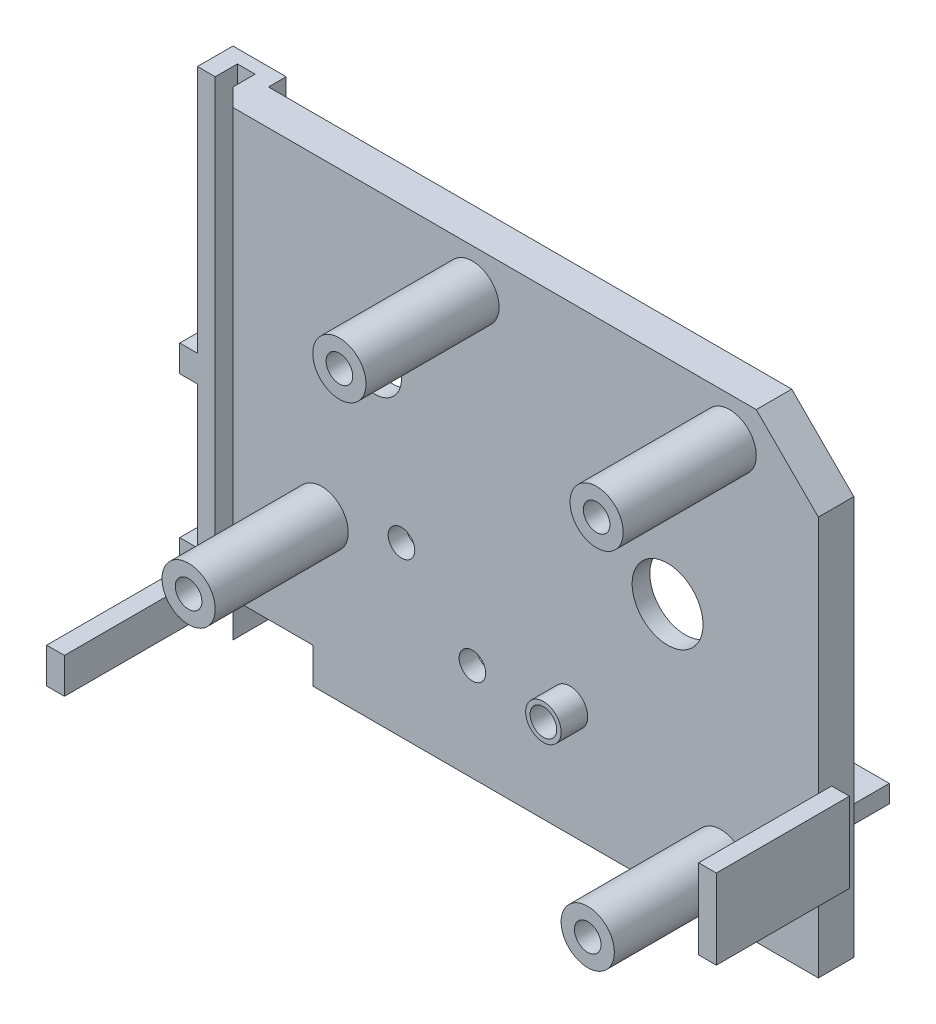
ISO-10303-21;
HEADER;
FILE_DESCRIPTION(('STEP AP214'),'2;1');
FILE_NAME('part.step','',(''),(''),'','','');
FILE_SCHEMA(('AUTOMOTIVE_DESIGN { 1 0 10303 214 1 1 1 1 }'));
ENDSEC;
DATA;
#1=APPLICATION_CONTEXT('core data for automotive mechanical design processes');
#2=APPLICATION_PROTOCOL_DEFINITION('international standard','automotive_design',2000,#1);
#3=PRODUCT_CONTEXT('',#1,'mechanical');
#4=PRODUCT('Part','Part','',(#3));
#5=PRODUCT_RELATED_PRODUCT_CATEGORY('part','',(#4));
#6=PRODUCT_DEFINITION_FORMATION('','',#4);
#7=PRODUCT_DEFINITION_CONTEXT('part definition',#1,'design');
#8=PRODUCT_DEFINITION('design','',#6,#7);
#9=PRODUCT_DEFINITION_SHAPE('','',#8);
#10=(LENGTH_UNIT() NAMED_UNIT(*) SI_UNIT(.MILLI.,.METRE.));
#11=(NAMED_UNIT(*) PLANE_ANGLE_UNIT() SI_UNIT($,.RADIAN.));
#12=(NAMED_UNIT(*) SI_UNIT($,.STERADIAN.) SOLID_ANGLE_UNIT());
#13=UNCERTAINTY_MEASURE_WITH_UNIT(LENGTH_MEASURE(1.E-05),#10,'distance_accuracy_value','');
#14=(GEOMETRIC_REPRESENTATION_CONTEXT(3) GLOBAL_UNCERTAINTY_ASSIGNED_CONTEXT((#13)) GLOBAL_UNIT_ASSIGNED_CONTEXT((#10,
#11,#12)) REPRESENTATION_CONTEXT('',''));
#15=CARTESIAN_POINT('',(0.,0.,0.));
#16=DIRECTION('',(0.,0.,1.));
#17=DIRECTION('',(1.,0.,0.));
#18=AXIS2_PLACEMENT_3D('',#15,#16,#17);
#19=CARTESIAN_POINT('',(-6.,7.,1.99999999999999));
#20=DIRECTION('',(0.,0.,-1.));
#21=DIRECTION('',(-1.,0.,0.));
#22=AXIS2_PLACEMENT_3D('',#19,#20,#21);
#23=PLANE('',#22);
#24=DIRECTION('',(-1.,0.,0.));
#25=VECTOR('',#24,1.);
#26=CARTESIAN_POINT('',(54.,3.,1.99999999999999));
#27=LINE('',#26,#25);
#28=CARTESIAN_POINT('',(54.,3.,1.99999999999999));
#29=VERTEX_POINT('',#28);
#30=CARTESIAN_POINT('',(42.,3.,1.99999999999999));
#31=VERTEX_POINT('',#30);
#32=EDGE_CURVE('E1146',#29,#31,#27,.T.);
#33=ORIENTED_EDGE('',*,*,#32,.T.);
#34=DIRECTION('',(0.,1.,0.));
#35=VECTOR('',#34,1.);
#36=CARTESIAN_POINT('',(42.,10.,1.99999999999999));
#37=LINE('',#36,#35);
#38=CARTESIAN_POINT('',(42.,10.,1.99999999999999));
#39=VERTEX_POINT('',#38);
#40=EDGE_CURVE('E742',#31,#39,#37,.T.);
#41=ORIENTED_EDGE('',*,*,#40,.T.);
#42=DIRECTION('',(1.,0.,0.));
#43=VECTOR('',#42,1.);
#44=CARTESIAN_POINT('',(54.,10.,1.99999999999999));
#45=LINE('',#44,#43);
#46=CARTESIAN_POINT('',(54.,10.,1.99999999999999));
#47=VERTEX_POINT('',#46);
#48=EDGE_CURVE('E756',#39,#47,#45,.T.);
#49=ORIENTED_EDGE('',*,*,#48,.T.);
#50=DIRECTION('',(0.,-1.,0.));
#51=VECTOR('',#50,1.);
#52=CARTESIAN_POINT('',(54.,43.7573593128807,1.99999999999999));
#53=LINE('',#52,#51);
#54=EDGE_CURVE('E1141',#47,#29,#53,.T.);
#55=ORIENTED_EDGE('',*,*,#54,.T.);
#56=EDGE_LOOP('',(#33,#41,#49,#55));
#57=FACE_BOUND('',#56,.T.);
#58=ADVANCED_FACE('F348',(#57),#23,.T.);
#59=CARTESIAN_POINT('',(54.,3.,1.99999999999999));
#60=DIRECTION('',(0.,-1.,0.));
#61=DIRECTION('',(0.,0.,-1.));
#62=AXIS2_PLACEMENT_3D('',#59,#60,#61);
#63=PLANE('',#62);
#64=DIRECTION('',(0.,0.,-1.));
#65=VECTOR('',#64,1.);
#66=CARTESIAN_POINT('',(42.,3.,1.99999999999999));
#67=LINE('',#66,#65);
#68=CARTESIAN_POINT('',(42.,3.,1.29443032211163));
#69=VERTEX_POINT('',#68);
#70=EDGE_CURVE('E750',#31,#69,#67,.T.);
#71=ORIENTED_EDGE('',*,*,#70,.F.);
#72=ORIENTED_EDGE('',*,*,#32,.F.);
#73=DIRECTION('',(0.,0.,-1.));
#74=VECTOR('',#73,1.);
#75=CARTESIAN_POINT('',(54.,3.,1.99999999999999));
#76=LINE('',#75,#74);
#77=CARTESIAN_POINT('',(54.,3.,0.));
#78=VERTEX_POINT('',#77);
#79=EDGE_CURVE('E1158',#29,#78,#76,.T.);
#80=ORIENTED_EDGE('',*,*,#79,.T.);
#81=DIRECTION('',(-1.,0.,0.));
#82=VECTOR('',#81,1.);
#83=CARTESIAN_POINT('',(54.,3.,0.));
#84=LINE('',#83,#82);
#85=CARTESIAN_POINT('',(3.,3.,0.));
#86=VERTEX_POINT('',#85);
#87=EDGE_CURVE('E1125',#78,#86,#84,.T.);
#88=ORIENTED_EDGE('',*,*,#87,.T.);
#89=DIRECTION('',(0.,0.,-1.));
#90=VECTOR('',#89,1.);
#91=CARTESIAN_POINT('',(3.,3.,1.99999999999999));
#92=LINE('',#91,#90);
#93=CARTESIAN_POINT('',(3.,3.,1.99999999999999));
#94=VERTEX_POINT('',#93);
#95=EDGE_CURVE('E1156',#94,#86,#92,.T.);
#96=ORIENTED_EDGE('',*,*,#95,.F.);
#97=CARTESIAN_POINT('',(40.,3.,1.99999999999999));
#98=VERTEX_POINT('',#97);
#99=EDGE_CURVE('E1145',#98,#94,#27,.T.);
#100=ORIENTED_EDGE('',*,*,#99,.F.);
#101=DIRECTION('',(0.,0.,-1.));
#102=VECTOR('',#101,1.);
#103=CARTESIAN_POINT('',(40.,3.,1.99999999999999));
#104=LINE('',#103,#102);
#105=CARTESIAN_POINT('',(40.,3.,1.29443032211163));
#106=VERTEX_POINT('',#105);
#107=EDGE_CURVE('E741',#98,#106,#104,.T.);
#108=ORIENTED_EDGE('',*,*,#107,.T.);
#109=DIRECTION('',(1.,0.,0.));
#110=VECTOR('',#109,1.);
#111=CARTESIAN_POINT('',(54.,3.,1.29443032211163));
#112=LINE('',#111,#110);
#113=EDGE_CURVE('E2047',#106,#69,#112,.T.);
#114=ORIENTED_EDGE('',*,*,#113,.T.);
#115=EDGE_LOOP('',(#71,#72,#80,#88,#96,#100,#108,#114));
#116=FACE_BOUND('',#115,.T.);
#117=ADVANCED_FACE('F1210',(#116),#63,.F.);
#118=CARTESIAN_POINT('',(54.,10.,16.1421356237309));
#119=DIRECTION('',(0.,-1.,0.));
#120=DIRECTION('',(0.,0.,-1.));
#121=AXIS2_PLACEMENT_3D('',#118,#119,#120);
#122=PLANE('',#121);
#123=ORIENTED_EDGE('',*,*,#48,.F.);
#124=DIRECTION('',(0.,0.,-1.));
#125=VECTOR('',#124,1.);
#126=CARTESIAN_POINT('',(42.,10.,1.99999999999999));
#127=LINE('',#126,#125);
#128=CARTESIAN_POINT('',(42.,10.,-7.));
#129=VERTEX_POINT('',#128);
#130=EDGE_CURVE('E747',#39,#129,#127,.T.);
#131=ORIENTED_EDGE('',*,*,#130,.T.);
#132=DIRECTION('',(-1.,0.,0.));
#133=VECTOR('',#132,1.);
#134=CARTESIAN_POINT('',(54.,10.,-7.));
#135=LINE('',#134,#133);
#136=CARTESIAN_POINT('',(47.,10.,-7.));
#137=VERTEX_POINT('',#136);
#138=EDGE_CURVE('E755',#137,#129,#135,.T.);
#139=ORIENTED_EDGE('',*,*,#138,.F.);
#140=DIRECTION('',(0.,0.,-1.));
#141=VECTOR('',#140,1.);
#142=CARTESIAN_POINT('',(47.,10.,-2.));
#143=LINE('',#142,#141);
#144=CARTESIAN_POINT('',(47.,10.,-2.));
#145=VERTEX_POINT('',#144);
#146=EDGE_CURVE('E367',#145,#137,#143,.T.);
#147=ORIENTED_EDGE('',*,*,#146,.F.);
#148=DIRECTION('',(-1.,0.,0.));
#149=VECTOR('',#148,1.);
#150=CARTESIAN_POINT('',(50.,10.,-2.));
#151=LINE('',#150,#149);
#152=CARTESIAN_POINT('',(50.,10.,-2.));
#153=VERTEX_POINT('',#152);
#154=EDGE_CURVE('E2038',#153,#145,#151,.T.);
#155=ORIENTED_EDGE('',*,*,#154,.F.);
#156=DIRECTION('',(0.,0.,-1.));
#157=VECTOR('',#156,1.);
#158=CARTESIAN_POINT('',(50.,10.,-2.));
#159=LINE('',#158,#157);
#160=CARTESIAN_POINT('',(50.,10.,-7.));
#161=VERTEX_POINT('',#160);
#162=EDGE_CURVE('E2024',#153,#161,#159,.T.);
#163=ORIENTED_EDGE('',*,*,#162,.T.);
#164=CARTESIAN_POINT('',(54.,10.,-7.));
#165=VERTEX_POINT('',#164);
#166=EDGE_CURVE('E761',#165,#161,#135,.T.);
#167=ORIENTED_EDGE('',*,*,#166,.F.);
#168=DIRECTION('',(0.,0.,-1.));
#169=VECTOR('',#168,1.);
#170=CARTESIAN_POINT('',(54.,10.,16.1421356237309));
#171=LINE('',#170,#169);
#172=CARTESIAN_POINT('',(54.,10.,0.));
#173=VERTEX_POINT('',#172);
#174=EDGE_CURVE('E375',#173,#165,#171,.T.);
#175=ORIENTED_EDGE('',*,*,#174,.F.);
#176=EDGE_CURVE('E782',#47,#173,#171,.T.);
#177=ORIENTED_EDGE('',*,*,#176,.F.);
#178=EDGE_LOOP('',(#123,#131,#139,#147,#155,#163,#167,#175,#177));
#179=FACE_BOUND('',#178,.T.);
#180=ADVANCED_FACE('F754',(#179),#122,.T.);
#181=CARTESIAN_POINT('',(54.,10.,-7.));
#182=DIRECTION('',(0.,0.,-1.));
#183=DIRECTION('',(-1.,0.,0.));
#184=AXIS2_PLACEMENT_3D('',#181,#182,#183);
#185=PLANE('',#184);
#186=DIRECTION('',(0.,-1.,0.));
#187=VECTOR('',#186,1.);
#188=CARTESIAN_POINT('',(50.,12.,-7.));
#189=LINE('',#188,#187);
#190=CARTESIAN_POINT('',(50.,12.,-7.));
#191=VERTEX_POINT('',#190);
#192=EDGE_CURVE('E2045',#191,#161,#189,.T.);
#193=ORIENTED_EDGE('',*,*,#192,.F.);
#194=DIRECTION('',(1.,0.,0.));
#195=VECTOR('',#194,1.);
#196=CARTESIAN_POINT('',(54.,12.,-7.));
#197=LINE('',#196,#195);
#198=CARTESIAN_POINT('',(54.,12.,-7.));
#199=VERTEX_POINT('',#198);
#200=EDGE_CURVE('E772',#191,#199,#197,.T.);
#201=ORIENTED_EDGE('',*,*,#200,.T.);
#202=DIRECTION('',(0.,-1.,0.));
#203=VECTOR('',#202,1.);
#204=CARTESIAN_POINT('',(54.,12.,-7.));
#205=LINE('',#204,#203);
#206=EDGE_CURVE('E762',#199,#165,#205,.T.);
#207=ORIENTED_EDGE('',*,*,#206,.T.);
#208=ORIENTED_EDGE('',*,*,#166,.T.);
#209=EDGE_LOOP('',(#193,#201,#207,#208));
#210=FACE_BOUND('',#209,.T.);
#211=ADVANCED_FACE('F1880',(#210),#185,.T.);
#212=CARTESIAN_POINT('',(54.,43.7573593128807,1.99999999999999));
#213=DIRECTION('',(1.,0.,0.));
#214=DIRECTION('',(0.,1.,0.));
#215=AXIS2_PLACEMENT_3D('',#212,#213,#214);
#216=PLANE('',#215);
#217=DIRECTION('',(0.,-1.,0.));
#218=VECTOR('',#217,1.);
#219=CARTESIAN_POINT('',(54.,43.7573593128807,0.));
#220=LINE('',#219,#218);
#221=CARTESIAN_POINT('',(54.,43.7573593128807,0.));
#222=VERTEX_POINT('',#221);
#223=CARTESIAN_POINT('',(54.,12.,0.));
#224=VERTEX_POINT('',#223);
#225=EDGE_CURVE('E1122',#222,#224,#220,.T.);
#226=ORIENTED_EDGE('',*,*,#225,.T.);
#227=DIRECTION('',(0.,0.,-1.));
#228=VECTOR('',#227,1.);
#229=CARTESIAN_POINT('',(54.,12.,16.1421356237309));
#230=LINE('',#229,#228);
#231=CARTESIAN_POINT('',(54.,12.,1.99999999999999));
#232=VERTEX_POINT('',#231);
#233=EDGE_CURVE('E775',#232,#224,#230,.T.);
#234=ORIENTED_EDGE('',*,*,#233,.F.);
#235=CARTESIAN_POINT('',(54.,43.7573593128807,1.99999999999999));
#236=VERTEX_POINT('',#235);
#237=EDGE_CURVE('E1142',#236,#232,#53,.T.);
#238=ORIENTED_EDGE('',*,*,#237,.F.);
#239=DIRECTION('',(0.,0.,-1.));
#240=VECTOR('',#239,1.);
#241=CARTESIAN_POINT('',(54.,43.7573593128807,1.99999999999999));
#242=LINE('',#241,#240);
#243=EDGE_CURVE('E1161',#236,#222,#242,.T.);
#244=ORIENTED_EDGE('',*,*,#243,.T.);
#245=EDGE_LOOP('',(#226,#234,#238,#244));
#246=FACE_BOUND('',#245,.T.);
#247=ADVANCED_FACE('F1185',(#246),#216,.F.);
#248=DIRECTION('',(0.,-1.,0.));
#249=VECTOR('',#248,1.);
#250=CARTESIAN_POINT('',(40.,12.,1.99999999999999));
#251=LINE('',#250,#249);
#252=CARTESIAN_POINT('',(40.,12.,1.99999999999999));
#253=VERTEX_POINT('',#252);
#254=EDGE_CURVE('E778',#253,#98,#251,.T.);
#255=ORIENTED_EDGE('',*,*,#254,.T.);
#256=ORIENTED_EDGE('',*,*,#99,.T.);
#257=DIRECTION('',(0.,1.,0.));
#258=VECTOR('',#257,1.);
#259=CARTESIAN_POINT('',(3.,3.,1.99999999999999));
#260=LINE('',#259,#258);
#261=CARTESIAN_POINT('',(3.,7.,1.99999999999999));
#262=VERTEX_POINT('',#261);
#263=EDGE_CURVE('E1149',#94,#262,#260,.T.);
#264=ORIENTED_EDGE('',*,*,#263,.T.);
#265=DIRECTION('',(-1.,0.,0.));
#266=VECTOR('',#265,1.);
#267=CARTESIAN_POINT('',(3.,7.,1.99999999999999));
#268=LINE('',#267,#266);
#269=CARTESIAN_POINT('',(-9.,7.,1.99999999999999));
#270=VERTEX_POINT('',#269);
#271=EDGE_CURVE('E1132',#262,#270,#268,.T.);
#272=ORIENTED_EDGE('',*,*,#271,.T.);
#273=DIRECTION('',(0.,1.,0.));
#274=VECTOR('',#273,1.);
#275=CARTESIAN_POINT('',(-9.00000000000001,49.,1.99999999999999));
#276=LINE('',#275,#274);
#277=CARTESIAN_POINT('',(-9.,21.,1.99999999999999));
#278=VERTEX_POINT('',#277);
#279=EDGE_CURVE('E1104',#270,#278,#276,.T.);
#280=ORIENTED_EDGE('',*,*,#279,.T.);
#281=DIRECTION('',(1.,0.,0.));
#282=VECTOR('',#281,1.);
#283=CARTESIAN_POINT('',(-9.00000000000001,21.,2.));
#284=LINE('',#283,#282);
#285=CARTESIAN_POINT('',(-8.,21.,1.99999999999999));
#286=VERTEX_POINT('',#285);
#287=EDGE_CURVE('E802',#278,#286,#284,.T.);
#288=ORIENTED_EDGE('',*,*,#287,.T.);
#289=DIRECTION('',(0.,-1.,0.));
#290=VECTOR('',#289,1.);
#291=CARTESIAN_POINT('',(-8.,21.,1.99999999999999));
#292=LINE('',#291,#290);
#293=CARTESIAN_POINT('',(-8.,9.,1.99999999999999));
#294=VERTEX_POINT('',#293);
#295=EDGE_CURVE('E792',#286,#294,#292,.T.);
#296=ORIENTED_EDGE('',*,*,#295,.T.);
#297=DIRECTION('',(1.,0.,0.));
#298=VECTOR('',#297,1.);
#299=CARTESIAN_POINT('',(-8.,9.,1.99999999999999));
#300=LINE('',#299,#298);
#301=CARTESIAN_POINT('',(-7.00000000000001,9.,1.99999999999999));
#302=VERTEX_POINT('',#301);
#303=EDGE_CURVE('E798',#294,#302,#300,.T.);
#304=ORIENTED_EDGE('',*,*,#303,.T.);
#305=DIRECTION('',(0.,-1.,0.));
#306=VECTOR('',#305,1.);
#307=CARTESIAN_POINT('',(-7.00000000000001,24.,2.));
#308=LINE('',#307,#306);
#309=CARTESIAN_POINT('',(-7.00000000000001,24.,1.99999999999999));
#310=VERTEX_POINT('',#309);
#311=EDGE_CURVE('E895',#310,#302,#308,.T.);
#312=ORIENTED_EDGE('',*,*,#311,.F.);
#313=DIRECTION('',(1.,0.,0.));
#314=VECTOR('',#313,1.);
#315=CARTESIAN_POINT('',(-9.00000000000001,24.,2.));
#316=LINE('',#315,#314);
#317=CARTESIAN_POINT('',(-9.,24.,1.99999999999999));
#318=VERTEX_POINT('',#317);
#319=EDGE_CURVE('E835',#318,#310,#316,.T.);
#320=ORIENTED_EDGE('',*,*,#319,.F.);
#321=CARTESIAN_POINT('',(-9.00000000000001,49.,1.99999999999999));
#322=VERTEX_POINT('',#321);
#323=EDGE_CURVE('E1103',#318,#322,#276,.T.);
#324=ORIENTED_EDGE('',*,*,#323,.T.);
#325=DIRECTION('',(1.,0.,0.));
#326=VECTOR('',#325,1.);
#327=CARTESIAN_POINT('',(-6.00000000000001,49.,1.99999999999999));
#328=LINE('',#327,#326);
#329=CARTESIAN_POINT('',(48.7573593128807,49.,1.99999999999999));
#330=VERTEX_POINT('',#329);
#331=EDGE_CURVE('E1135',#322,#330,#328,.T.);
#332=ORIENTED_EDGE('',*,*,#331,.T.);
#333=DIRECTION('',(0.707106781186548,-0.707106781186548,0.));
#334=VECTOR('',#333,1.);
#335=CARTESIAN_POINT('',(48.7573593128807,49.,1.99999999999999));
#336=LINE('',#335,#334);
#337=EDGE_CURVE('E1138',#330,#236,#336,.T.);
#338=ORIENTED_EDGE('',*,*,#337,.T.);
#339=ORIENTED_EDGE('',*,*,#237,.T.);
#340=DIRECTION('',(-1.,0.,0.));
#341=VECTOR('',#340,1.);
#342=CARTESIAN_POINT('',(54.,12.,1.99999999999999));
#343=LINE('',#342,#341);
#344=EDGE_CURVE('E787',#232,#253,#343,.T.);
#345=ORIENTED_EDGE('',*,*,#344,.T.);
#346=EDGE_LOOP('',(#255,#256,#264,#272,#280,#288,#296,#304,#312,#320,#324,#332,#338,#339,#345));
#347=FACE_BOUND('',#346,.T.);
#348=CARTESIAN_POINT('',(40.,28.,1.99999999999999));
#349=DIRECTION('',(0.,0.,-1.));
#350=DIRECTION('',(-1.,0.,0.));
#351=AXIS2_PLACEMENT_3D('',#348,#349,#350);
#352=CIRCLE('',#351,4.00000000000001);
#353=CARTESIAN_POINT('',(36.,28.,1.99999999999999));
#354=VERTEX_POINT('',#353);
#355=EDGE_CURVE('E1097',#354,#354,#352,.T.);
#356=ORIENTED_EDGE('',*,*,#355,.F.);
#357=EDGE_LOOP('',(#356));
#358=FACE_BOUND('',#357,.T.);
#359=CARTESIAN_POINT('',(7.,35.,1.99999999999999));
#360=DIRECTION('',(0.,0.,-1.));
#361=DIRECTION('',(-1.,0.,0.));
#362=AXIS2_PLACEMENT_3D('',#359,#360,#361);
#363=CIRCLE('',#362,3.);
#364=CARTESIAN_POINT('',(4.,35.,1.99999999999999));
#365=VERTEX_POINT('',#364);
#366=EDGE_CURVE('E1090',#365,#365,#363,.T.);
#367=ORIENTED_EDGE('',*,*,#366,.F.);
#368=EDGE_LOOP('',(#367));
#369=FACE_BOUND('',#368,.T.);
#370=CARTESIAN_POINT('',(10.,19.,1.99999999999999));
#371=DIRECTION('',(0.,0.,-1.));
#372=DIRECTION('',(-1.,0.,0.));
#373=AXIS2_PLACEMENT_3D('',#370,#371,#372);
#374=CIRCLE('',#373,1.5);
#375=CARTESIAN_POINT('',(8.5,19.,1.99999999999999));
#376=VERTEX_POINT('',#375);
#377=EDGE_CURVE('E1024',#376,#376,#374,.T.);
#378=ORIENTED_EDGE('',*,*,#377,.F.);
#379=EDGE_LOOP('',(#378));
#380=FACE_BOUND('',#379,.T.);
#381=CARTESIAN_POINT('',(18.,11.,1.99999999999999));
#382=DIRECTION('',(0.,0.,-1.));
#383=DIRECTION('',(-1.,0.,0.));
#384=AXIS2_PLACEMENT_3D('',#381,#382,#383);
#385=CIRCLE('',#384,1.5);
#386=CARTESIAN_POINT('',(16.5,11.,1.99999999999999));
#387=VERTEX_POINT('',#386);
#388=EDGE_CURVE('E1020',#387,#387,#385,.T.);
#389=ORIENTED_EDGE('',*,*,#388,.F.);
#390=EDGE_LOOP('',(#389));
#391=FACE_BOUND('',#390,.T.);
#392=CARTESIAN_POINT('',(29.,12.5,1.99999999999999));
#393=DIRECTION('',(0.,0.,-1.));
#394=DIRECTION('',(-1.,0.,0.));
#395=AXIS2_PLACEMENT_3D('',#392,#393,#394);
#396=CIRCLE('',#395,1.5);
#397=CARTESIAN_POINT('',(27.5,12.5,1.99999999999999));
#398=VERTEX_POINT('',#397);
#399=EDGE_CURVE('E952',#398,#398,#396,.T.);
#400=ORIENTED_EDGE('',*,*,#399,.F.);
#401=EDGE_LOOP('',(#400));
#402=FACE_BOUND('',#401,.T.);
#403=ADVANCED_FACE('F1181',(#347,#358,#369,#380,#391,#402),#23,.T.);
#404=CARTESIAN_POINT('',(-9.,0.,4.));
#405=DIRECTION('',(1.,0.,0.));
#406=DIRECTION('',(0.,1.,0.));
#407=AXIS2_PLACEMENT_3D('',#404,#405,#406);
#408=PLANE('',#407);
#409=ORIENTED_EDGE('',*,*,#323,.F.);
#410=DIRECTION('',(0.,0.,1.));
#411=VECTOR('',#410,1.);
#412=CARTESIAN_POINT('',(-9.00000000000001,24.,-2.));
#413=LINE('',#412,#411);
#414=CARTESIAN_POINT('',(-9.,24.,-2.));
#415=VERTEX_POINT('',#414);
#416=EDGE_CURVE('E865',#415,#318,#413,.T.);
#417=ORIENTED_EDGE('',*,*,#416,.F.);
#418=DIRECTION('',(0.,1.,0.));
#419=VECTOR('',#418,1.);
#420=CARTESIAN_POINT('',(-9.,0.,-2.));
#421=LINE('',#420,#419);
#422=CARTESIAN_POINT('',(-9.00000000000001,52.,-2.));
#423=VERTEX_POINT('',#422);
#424=EDGE_CURVE('E1088',#415,#423,#421,.T.);
#425=ORIENTED_EDGE('',*,*,#424,.T.);
#426=DIRECTION('',(0.,0.,-1.));
#427=VECTOR('',#426,1.);
#428=CARTESIAN_POINT('',(-9.00000000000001,52.,4.));
#429=LINE('',#428,#427);
#430=CARTESIAN_POINT('',(-9.00000000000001,52.,0.));
#431=VERTEX_POINT('',#430);
#432=EDGE_CURVE('E1076',#431,#423,#429,.T.);
#433=ORIENTED_EDGE('',*,*,#432,.F.);
#434=DIRECTION('',(0.,-1.,0.));
#435=VECTOR('',#434,1.);
#436=CARTESIAN_POINT('',(-9.00000000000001,52.,0.));
#437=LINE('',#436,#435);
#438=CARTESIAN_POINT('',(-9.00000000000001,49.,0.));
#439=VERTEX_POINT('',#438);
#440=EDGE_CURVE('E1166',#431,#439,#437,.T.);
#441=ORIENTED_EDGE('',*,*,#440,.T.);
#442=DIRECTION('',(0.,0.,-1.));
#443=VECTOR('',#442,1.);
#444=CARTESIAN_POINT('',(-9.00000000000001,49.,1.99999999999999));
#445=LINE('',#444,#443);
#446=EDGE_CURVE('E1108',#322,#439,#445,.T.);
#447=ORIENTED_EDGE('',*,*,#446,.F.);
#448=EDGE_LOOP('',(#409,#417,#425,#433,#441,#447));
#449=FACE_BOUND('',#448,.T.);
#450=ADVANCED_FACE('F1184',(#449),#408,.T.);
#451=CARTESIAN_POINT('',(-15.,0.,-2.));
#452=DIRECTION('',(-1.,0.,0.));
#453=DIRECTION('',(0.,-1.,0.));
#454=AXIS2_PLACEMENT_3D('',#451,#452,#453);
#455=PLANE('',#454);
#456=DIRECTION('',(0.,1.,0.));
#457=VECTOR('',#456,1.);
#458=CARTESIAN_POINT('',(-15.,0.,-2.));
#459=LINE('',#458,#457);
#460=CARTESIAN_POINT('',(-15.,24.,-2.));
#461=VERTEX_POINT('',#460);
#462=CARTESIAN_POINT('',(-15.,52.,-2.));
#463=VERTEX_POINT('',#462);
#464=EDGE_CURVE('E939',#461,#463,#459,.T.);
#465=ORIENTED_EDGE('',*,*,#464,.F.);
#466=DIRECTION('',(0.,0.,-1.));
#467=VECTOR('',#466,1.);
#468=CARTESIAN_POINT('',(-15.,24.,2.));
#469=LINE('',#468,#467);
#470=CARTESIAN_POINT('',(-15.,24.,2.));
#471=VERTEX_POINT('',#470);
#472=EDGE_CURVE('E859',#471,#461,#469,.T.);
#473=ORIENTED_EDGE('',*,*,#472,.F.);
#474=DIRECTION('',(0.,1.,0.));
#475=VECTOR('',#474,1.);
#476=CARTESIAN_POINT('',(-15.,0.,2.));
#477=LINE('',#476,#475);
#478=CARTESIAN_POINT('',(-15.,52.,2.));
#479=VERTEX_POINT('',#478);
#480=EDGE_CURVE('E352',#471,#479,#477,.T.);
#481=ORIENTED_EDGE('',*,*,#480,.T.);
#482=DIRECTION('',(0.,0.,1.));
#483=VECTOR('',#482,1.);
#484=CARTESIAN_POINT('',(-15.,52.,-2.));
#485=LINE('',#484,#483);
#486=EDGE_CURVE('E1415',#463,#479,#485,.T.);
#487=ORIENTED_EDGE('',*,*,#486,.F.);
#488=EDGE_LOOP('',(#465,#473,#481,#487));
#489=FACE_BOUND('',#488,.T.);
#490=ADVANCED_FACE('F1604',(#489),#455,.T.);
#491=CARTESIAN_POINT('',(-9.,0.,-2.));
#492=DIRECTION('',(0.,0.,-1.));
#493=DIRECTION('',(-1.,0.,0.));
#494=AXIS2_PLACEMENT_3D('',#491,#492,#493);
#495=PLANE('',#494);
#496=ORIENTED_EDGE('',*,*,#424,.F.);
#497=DIRECTION('',(1.,0.,0.));
#498=VECTOR('',#497,1.);
#499=CARTESIAN_POINT('',(-15.,24.,-2.));
#500=LINE('',#499,#498);
#501=EDGE_CURVE('E862',#461,#415,#500,.T.);
#502=ORIENTED_EDGE('',*,*,#501,.F.);
#503=ORIENTED_EDGE('',*,*,#464,.T.);
#504=DIRECTION('',(-1.,0.,0.));
#505=VECTOR('',#504,1.);
#506=CARTESIAN_POINT('',(-9.00000000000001,52.,-2.));
#507=LINE('',#506,#505);
#508=EDGE_CURVE('E1079',#423,#463,#507,.T.);
#509=ORIENTED_EDGE('',*,*,#508,.F.);
#510=EDGE_LOOP('',(#496,#502,#503,#509));
#511=FACE_BOUND('',#510,.T.);
#512=ADVANCED_FACE('F1261',(#511),#495,.T.);
#513=CARTESIAN_POINT('',(57.,45.,4.));
#514=DIRECTION('',(-1.,0.,0.));
#515=DIRECTION('',(0.,-1.,0.));
#516=AXIS2_PLACEMENT_3D('',#513,#514,#515);
#517=PLANE('',#516);
#518=DIRECTION('',(0.,0.,1.));
#519=VECTOR('',#518,1.);
#520=CARTESIAN_POINT('',(57.,18.,17.5));
#521=LINE('',#520,#519);
#522=CARTESIAN_POINT('',(57.,18.,2.5));
#523=VERTEX_POINT('',#522);
#524=CARTESIAN_POINT('',(57.,18.,4.));
#525=VERTEX_POINT('',#524);
#526=EDGE_CURVE('E984',#523,#525,#521,.T.);
#527=ORIENTED_EDGE('',*,*,#526,.F.);
#528=DIRECTION('',(0.,1.,0.));
#529=VECTOR('',#528,1.);
#530=CARTESIAN_POINT('',(57.,9.,2.5));
#531=LINE('',#530,#529);
#532=CARTESIAN_POINT('',(57.,9.,2.5));
#533=VERTEX_POINT('',#532);
#534=EDGE_CURVE('E980',#533,#523,#531,.T.);
#535=ORIENTED_EDGE('',*,*,#534,.F.);
#536=DIRECTION('',(0.,0.,-1.));
#537=VECTOR('',#536,1.);
#538=CARTESIAN_POINT('',(57.,9.,17.5));
#539=LINE('',#538,#537);
#540=CARTESIAN_POINT('',(57.,9.,4.));
#541=VERTEX_POINT('',#540);
#542=EDGE_CURVE('E11',#541,#533,#539,.T.);
#543=ORIENTED_EDGE('',*,*,#542,.F.);
#544=DIRECTION('',(0.,1.,0.));
#545=VECTOR('',#544,1.);
#546=CARTESIAN_POINT('',(57.,45.,4.));
#547=LINE('',#546,#545);
#548=CARTESIAN_POINT('',(57.,0.,4.));
#549=VERTEX_POINT('',#548);
#550=EDGE_CURVE('E1305',#549,#541,#547,.T.);
#551=ORIENTED_EDGE('',*,*,#550,.F.);
#552=DIRECTION('',(0.,0.,-1.));
#553=VECTOR('',#552,1.);
#554=CARTESIAN_POINT('',(57.,0.,4.));
#555=LINE('',#554,#553);
#556=CARTESIAN_POINT('',(57.,0.,0.));
#557=VERTEX_POINT('',#556);
#558=EDGE_CURVE('E1288',#549,#557,#555,.T.);
#559=ORIENTED_EDGE('',*,*,#558,.T.);
#560=DIRECTION('',(0.,1.,0.));
#561=VECTOR('',#560,1.);
#562=CARTESIAN_POINT('',(57.,45.,0.));
#563=LINE('',#562,#561);
#564=CARTESIAN_POINT('',(57.,45.,0.));
#565=VERTEX_POINT('',#564);
#566=EDGE_CURVE('E1293',#557,#565,#563,.T.);
#567=ORIENTED_EDGE('',*,*,#566,.T.);
#568=DIRECTION('',(0.,0.,-1.));
#569=VECTOR('',#568,1.);
#570=CARTESIAN_POINT('',(57.,45.,4.));
#571=LINE('',#570,#569);
#572=CARTESIAN_POINT('',(57.,45.,4.));
#573=VERTEX_POINT('',#572);
#574=EDGE_CURVE('E1317',#573,#565,#571,.T.);
#575=ORIENTED_EDGE('',*,*,#574,.F.);
#576=EDGE_CURVE('E1304',#525,#573,#547,.T.);
#577=ORIENTED_EDGE('',*,*,#576,.F.);
#578=EDGE_LOOP('',(#527,#535,#543,#551,#559,#567,#575,#577));
#579=FACE_BOUND('',#578,.T.);
#580=ADVANCED_FACE('F1249',(#579),#517,.F.);
#581=CARTESIAN_POINT('',(-9.,0.,4.));
#582=DIRECTION('',(0.,0.,1.));
#583=DIRECTION('',(1.,0.,0.));
#584=AXIS2_PLACEMENT_3D('',#581,#582,#583);
#585=PLANE('',#584);
#586=CARTESIAN_POINT('',(46.,6.,4.));
#587=DIRECTION('',(0.,0.,1.));
#588=DIRECTION('',(1.,0.,0.));
#589=AXIS2_PLACEMENT_3D('',#586,#587,#588);
#590=CIRCLE('',#589,3.);
#591=CARTESIAN_POINT('',(49.,6.,4.));
#592=VERTEX_POINT('',#591);
#593=EDGE_CURVE('E1049',#592,#592,#590,.T.);
#594=ORIENTED_EDGE('',*,*,#593,.F.);
#595=EDGE_LOOP('',(#594));
#596=FACE_BOUND('',#595,.T.);
#597=CARTESIAN_POINT('',(18.,47.5,4.));
#598=DIRECTION('',(0.,0.,1.));
#599=DIRECTION('',(1.,0.,0.));
#600=AXIS2_PLACEMENT_3D('',#597,#598,#599);
#601=CIRCLE('',#600,3.);
#602=CARTESIAN_POINT('',(21.,47.5,4.));
#603=VERTEX_POINT('',#602);
#604=EDGE_CURVE('E1061',#603,#603,#601,.T.);
#605=ORIENTED_EDGE('',*,*,#604,.F.);
#606=EDGE_LOOP('',(#605));
#607=FACE_BOUND('',#606,.T.);
#608=DIRECTION('',(0.,-1.,0.));
#609=VECTOR('',#608,1.);
#610=CARTESIAN_POINT('',(-9.00000000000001,52.,4.));
#611=LINE('',#610,#609);
#612=CARTESIAN_POINT('',(-9.00000000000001,52.,4.));
#613=VERTEX_POINT('',#612);
#614=CARTESIAN_POINT('',(-9.,4.,4.));
#615=VERTEX_POINT('',#614);
#616=EDGE_CURVE('E1327',#613,#615,#611,.T.);
#617=ORIENTED_EDGE('',*,*,#616,.T.);
#618=DIRECTION('',(1.,0.,0.));
#619=VECTOR('',#618,1.);
#620=CARTESIAN_POINT('',(-9.,4.,4.));
#621=LINE('',#620,#619);
#622=CARTESIAN_POINT('',(0.,4.,4.));
#623=VERTEX_POINT('',#622);
#624=EDGE_CURVE('E1302',#615,#623,#621,.T.);
#625=ORIENTED_EDGE('',*,*,#624,.T.);
#626=DIRECTION('',(0.,-1.,0.));
#627=VECTOR('',#626,1.);
#628=CARTESIAN_POINT('',(0.,4.,4.));
#629=LINE('',#628,#627);
#630=CARTESIAN_POINT('',(0.,0.,4.));
#631=VERTEX_POINT('',#630);
#632=EDGE_CURVE('E1300',#623,#631,#629,.T.);
#633=ORIENTED_EDGE('',*,*,#632,.T.);
#634=DIRECTION('',(1.,0.,0.));
#635=VECTOR('',#634,1.);
#636=CARTESIAN_POINT('',(0.,0.,4.));
#637=LINE('',#636,#635);
#638=EDGE_CURVE('E1287',#631,#549,#637,.T.);
#639=ORIENTED_EDGE('',*,*,#638,.T.);
#640=ORIENTED_EDGE('',*,*,#550,.T.);
#641=EDGE_CURVE('E1309',#541,#525,#547,.T.);
#642=ORIENTED_EDGE('',*,*,#641,.T.);
#643=ORIENTED_EDGE('',*,*,#576,.T.);
#644=DIRECTION('',(-0.707106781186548,0.707106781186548,0.));
#645=VECTOR('',#644,1.);
#646=CARTESIAN_POINT('',(50.,52.,4.));
#647=LINE('',#646,#645);
#648=CARTESIAN_POINT('',(50.,52.,4.));
#649=VERTEX_POINT('',#648);
#650=EDGE_CURVE('E1308',#573,#649,#647,.T.);
#651=ORIENTED_EDGE('',*,*,#650,.T.);
#652=DIRECTION('',(-1.,0.,0.));
#653=VECTOR('',#652,1.);
#654=CARTESIAN_POINT('',(-9.00000000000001,52.,4.));
#655=LINE('',#654,#653);
#656=EDGE_CURVE('E1311',#649,#613,#655,.T.);
#657=ORIENTED_EDGE('',*,*,#656,.T.);
#658=EDGE_LOOP('',(#617,#625,#633,#639,#640,#642,#643,#651,#657));
#659=FACE_BOUND('',#658,.T.);
#660=CARTESIAN_POINT('',(40.,28.,4.));
#661=DIRECTION('',(0.,0.,-1.));
#662=DIRECTION('',(-1.,0.,0.));
#663=AXIS2_PLACEMENT_3D('',#660,#661,#662);
#664=CIRCLE('',#663,4.00000000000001);
#665=CARTESIAN_POINT('',(36.,28.,4.));
#666=VERTEX_POINT('',#665);
#667=EDGE_CURVE('E1100',#666,#666,#664,.T.);
#668=ORIENTED_EDGE('',*,*,#667,.T.);
#669=EDGE_LOOP('',(#668));
#670=FACE_BOUND('',#669,.T.);
#671=CARTESIAN_POINT('',(7.,35.,4.));
#672=DIRECTION('',(0.,0.,-1.));
#673=DIRECTION('',(-1.,0.,0.));
#674=AXIS2_PLACEMENT_3D('',#671,#672,#673);
#675=CIRCLE('',#674,3.);
#676=CARTESIAN_POINT('',(4.,35.,4.));
#677=VERTEX_POINT('',#676);
#678=EDGE_CURVE('E1093',#677,#677,#675,.T.);
#679=ORIENTED_EDGE('',*,*,#678,.T.);
#680=EDGE_LOOP('',(#679));
#681=FACE_BOUND('',#680,.T.);
#682=CARTESIAN_POINT('',(47.,47.5,4.));
#683=DIRECTION('',(0.,0.,1.));
#684=DIRECTION('',(1.,0.,0.));
#685=AXIS2_PLACEMENT_3D('',#682,#683,#684);
#686=CIRCLE('',#685,3.);
#687=CARTESIAN_POINT('',(50.,47.5,4.));
#688=VERTEX_POINT('',#687);
#689=EDGE_CURVE('E1067',#688,#688,#686,.T.);
#690=ORIENTED_EDGE('',*,*,#689,.F.);
#691=EDGE_LOOP('',(#690));
#692=FACE_BOUND('',#691,.T.);
#693=CARTESIAN_POINT('',(1.,17.,4.));
#694=DIRECTION('',(0.,0.,1.));
#695=DIRECTION('',(1.,0.,0.));
#696=AXIS2_PLACEMENT_3D('',#693,#694,#695);
#697=CIRCLE('',#696,3.);
#698=CARTESIAN_POINT('',(4.,17.,4.));
#699=VERTEX_POINT('',#698);
#700=EDGE_CURVE('E1055',#699,#699,#697,.T.);
#701=ORIENTED_EDGE('',*,*,#700,.F.);
#702=EDGE_LOOP('',(#701));
#703=FACE_BOUND('',#702,.T.);
#704=CARTESIAN_POINT('',(10.,19.,4.));
#705=DIRECTION('',(0.,0.,1.));
#706=DIRECTION('',(1.,0.,0.));
#707=AXIS2_PLACEMENT_3D('',#704,#705,#706);
#708=CIRCLE('',#707,1.5);
#709=CARTESIAN_POINT('',(11.5,19.,4.));
#710=VERTEX_POINT('',#709);
#711=EDGE_CURVE('E1021',#710,#710,#708,.T.);
#712=ORIENTED_EDGE('',*,*,#711,.F.);
#713=EDGE_LOOP('',(#712));
#714=FACE_BOUND('',#713,.T.);
#715=CARTESIAN_POINT('',(18.,11.,4.));
#716=DIRECTION('',(0.,0.,1.));
#717=DIRECTION('',(1.,0.,0.));
#718=AXIS2_PLACEMENT_3D('',#715,#716,#717);
#719=CIRCLE('',#718,1.5);
#720=CARTESIAN_POINT('',(19.5,11.,4.));
#721=VERTEX_POINT('',#720);
#722=EDGE_CURVE('E1017',#721,#721,#719,.T.);
#723=ORIENTED_EDGE('',*,*,#722,.F.);
#724=EDGE_LOOP('',(#723));
#725=FACE_BOUND('',#724,.T.);
#726=CARTESIAN_POINT('',(29.,12.5,4.));
#727=DIRECTION('',(0.,0.,1.));
#728=DIRECTION('',(1.,0.,0.));
#729=AXIS2_PLACEMENT_3D('',#726,#727,#728);
#730=CIRCLE('',#729,2.);
#731=CARTESIAN_POINT('',(31.,12.5,4.));
#732=VERTEX_POINT('',#731);
#733=EDGE_CURVE('E1011',#732,#732,#730,.T.);
#734=ORIENTED_EDGE('',*,*,#733,.F.);
#735=EDGE_LOOP('',(#734));
#736=FACE_BOUND('',#735,.T.);
#737=ADVANCED_FACE('F1246',(#596,#607,#659,#670,#681,#692,#703,#714,#725,#736),#585,.T.);
#738=CARTESIAN_POINT('',(-9.,4.,4.));
#739=DIRECTION('',(0.,1.,0.));
#740=DIRECTION('',(0.,0.,1.));
#741=AXIS2_PLACEMENT_3D('',#738,#739,#740);
#742=PLANE('',#741);
#743=DIRECTION('',(1.,0.,0.));
#744=VECTOR('',#743,1.);
#745=CARTESIAN_POINT('',(-9.,4.,0.));
#746=LINE('',#745,#744);
#747=CARTESIAN_POINT('',(-9.,4.,0.));
#748=VERTEX_POINT('',#747);
#749=CARTESIAN_POINT('',(0.,4.,0.));
#750=VERTEX_POINT('',#749);
#751=EDGE_CURVE('E1167',#748,#750,#746,.T.);
#752=ORIENTED_EDGE('',*,*,#751,.T.);
#753=DIRECTION('',(0.,0.,-1.));
#754=VECTOR('',#753,1.);
#755=CARTESIAN_POINT('',(0.,4.,4.));
#756=LINE('',#755,#754);
#757=EDGE_CURVE('E1281',#623,#750,#756,.T.);
#758=ORIENTED_EDGE('',*,*,#757,.F.);
#759=ORIENTED_EDGE('',*,*,#624,.F.);
#760=DIRECTION('',(0.,0.,-1.));
#761=VECTOR('',#760,1.);
#762=CARTESIAN_POINT('',(-9.,4.,4.));
#763=LINE('',#762,#761);
#764=EDGE_CURVE('E358',#615,#748,#763,.T.);
#765=ORIENTED_EDGE('',*,*,#764,.T.);
#766=EDGE_LOOP('',(#752,#758,#759,#765));
#767=FACE_BOUND('',#766,.T.);
#768=ADVANCED_FACE('F350',(#767),#742,.F.);
#769=CARTESIAN_POINT('',(0.,4.,4.));
#770=DIRECTION('',(1.,0.,0.));
#771=DIRECTION('',(0.,1.,0.));
#772=AXIS2_PLACEMENT_3D('',#769,#770,#771);
#773=PLANE('',#772);
#774=DIRECTION('',(0.,-1.,0.));
#775=VECTOR('',#774,1.);
#776=CARTESIAN_POINT('',(0.,4.,0.));
#777=LINE('',#776,#775);
#778=CARTESIAN_POINT('',(0.,0.,0.));
#779=VERTEX_POINT('',#778);
#780=EDGE_CURVE('E1275',#750,#779,#777,.T.);
#781=ORIENTED_EDGE('',*,*,#780,.T.);
#782=DIRECTION('',(0.,0.,-1.));
#783=VECTOR('',#782,1.);
#784=CARTESIAN_POINT('',(0.,0.,4.));
#785=LINE('',#784,#783);
#786=EDGE_CURVE('E1278',#631,#779,#785,.T.);
#787=ORIENTED_EDGE('',*,*,#786,.F.);
#788=ORIENTED_EDGE('',*,*,#632,.F.);
#789=ORIENTED_EDGE('',*,*,#757,.T.);
#790=EDGE_LOOP('',(#781,#787,#788,#789));
#791=FACE_BOUND('',#790,.T.);
#792=ADVANCED_FACE('F1264',(#791),#773,.F.);
#793=CARTESIAN_POINT('',(0.,0.,4.));
#794=DIRECTION('',(0.,1.,0.));
#795=DIRECTION('',(-1.,0.,0.));
#796=AXIS2_PLACEMENT_3D('',#793,#794,#795);
#797=PLANE('',#796);
#798=DIRECTION('',(1.,0.,0.));
#799=VECTOR('',#798,1.);
#800=CARTESIAN_POINT('',(0.,0.,0.));
#801=LINE('',#800,#799);
#802=EDGE_CURVE('E1284',#779,#557,#801,.T.);
#803=ORIENTED_EDGE('',*,*,#802,.T.);
#804=ORIENTED_EDGE('',*,*,#558,.F.);
#805=ORIENTED_EDGE('',*,*,#638,.F.);
#806=ORIENTED_EDGE('',*,*,#786,.T.);
#807=EDGE_LOOP('',(#803,#804,#805,#806));
#808=FACE_BOUND('',#807,.T.);
#809=ADVANCED_FACE('F1257',(#808),#797,.F.);
#810=CARTESIAN_POINT('',(50.,52.,4.));
#811=DIRECTION('',(-0.707106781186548,-0.707106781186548,0.));
#812=DIRECTION('',(0.707106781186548,-0.707106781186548,0.));
#813=AXIS2_PLACEMENT_3D('',#810,#811,#812);
#814=PLANE('',#813);
#815=DIRECTION('',(-0.707106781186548,0.707106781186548,0.));
#816=VECTOR('',#815,1.);
#817=CARTESIAN_POINT('',(50.,52.,0.));
#818=LINE('',#817,#816);
#819=CARTESIAN_POINT('',(50.,52.,0.));
#820=VERTEX_POINT('',#819);
#821=EDGE_CURVE('E1295',#565,#820,#818,.T.);
#822=ORIENTED_EDGE('',*,*,#821,.T.);
#823=DIRECTION('',(0.,0.,-1.));
#824=VECTOR('',#823,1.);
#825=CARTESIAN_POINT('',(50.,52.,4.));
#826=LINE('',#825,#824);
#827=EDGE_CURVE('E1314',#649,#820,#826,.T.);
#828=ORIENTED_EDGE('',*,*,#827,.F.);
#829=ORIENTED_EDGE('',*,*,#650,.F.);
#830=ORIENTED_EDGE('',*,*,#574,.T.);
#831=EDGE_LOOP('',(#822,#828,#829,#830));
#832=FACE_BOUND('',#831,.T.);
#833=ADVANCED_FACE('F1253',(#832),#814,.F.);
#834=CARTESIAN_POINT('',(-9.00000000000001,52.,4.));
#835=DIRECTION('',(0.,-1.,0.));
#836=DIRECTION('',(0.,0.,-1.));
#837=AXIS2_PLACEMENT_3D('',#834,#835,#836);
#838=PLANE('',#837);
#839=DIRECTION('',(-1.,0.,0.));
#840=VECTOR('',#839,1.);
#841=CARTESIAN_POINT('',(-9.00000000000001,52.,0.));
#842=LINE('',#841,#840);
#843=EDGE_CURVE('E1299',#820,#431,#842,.T.);
#844=ORIENTED_EDGE('',*,*,#843,.T.);
#845=ORIENTED_EDGE('',*,*,#432,.T.);
#846=ORIENTED_EDGE('',*,*,#508,.T.);
#847=ORIENTED_EDGE('',*,*,#486,.T.);
#848=DIRECTION('',(1.,0.,0.));
#849=VECTOR('',#848,1.);
#850=CARTESIAN_POINT('',(-15.,52.,2.));
#851=LINE('',#850,#849);
#852=CARTESIAN_POINT('',(-13.,52.,2.));
#853=VERTEX_POINT('',#852);
#854=EDGE_CURVE('E1403',#479,#853,#851,.T.);
#855=ORIENTED_EDGE('',*,*,#854,.T.);
#856=DIRECTION('',(0.,0.,-1.));
#857=VECTOR('',#856,1.);
#858=CARTESIAN_POINT('',(-13.,52.,2.));
#859=LINE('',#858,#857);
#860=CARTESIAN_POINT('',(-13.,52.,-0.5));
#861=VERTEX_POINT('',#860);
#862=EDGE_CURVE('E1409',#853,#861,#859,.T.);
#863=ORIENTED_EDGE('',*,*,#862,.T.);
#864=DIRECTION('',(1.,0.,0.));
#865=VECTOR('',#864,1.);
#866=CARTESIAN_POINT('',(-13.,52.,-0.5));
#867=LINE('',#866,#865);
#868=CARTESIAN_POINT('',(-11.,52.,-0.500000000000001));
#869=VERTEX_POINT('',#868);
#870=EDGE_CURVE('E1380',#861,#869,#867,.T.);
#871=ORIENTED_EDGE('',*,*,#870,.T.);
#872=DIRECTION('',(0.,0.,1.));
#873=VECTOR('',#872,1.);
#874=CARTESIAN_POINT('',(-11.,52.,-0.500000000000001));
#875=LINE('',#874,#873);
#876=CARTESIAN_POINT('',(-11.,52.,2.));
#877=VERTEX_POINT('',#876);
#878=EDGE_CURVE('E1376',#869,#877,#875,.T.);
#879=ORIENTED_EDGE('',*,*,#878,.T.);
#880=DIRECTION('',(0.707106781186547,0.,0.707106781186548));
#881=VECTOR('',#880,1.);
#882=CARTESIAN_POINT('',(-11.,52.,2.));
#883=LINE('',#882,#881);
#884=EDGE_CURVE('E1073',#877,#613,#883,.T.);
#885=ORIENTED_EDGE('',*,*,#884,.T.);
#886=ORIENTED_EDGE('',*,*,#656,.F.);
#887=ORIENTED_EDGE('',*,*,#827,.T.);
#888=EDGE_LOOP('',(#844,#845,#846,#847,#855,#863,#871,#879,#885,#886,#887));
#889=FACE_BOUND('',#888,.T.);
#890=ADVANCED_FACE('F1244',(#889),#838,.F.);
#891=CARTESIAN_POINT('',(-9.,0.,0.));
#892=DIRECTION('',(0.,0.,1.));
#893=DIRECTION('',(1.,0.,0.));
#894=AXIS2_PLACEMENT_3D('',#891,#892,#893);
#895=PLANE('',#894);
#896=CARTESIAN_POINT('',(-9.,7.,0.));
#897=VERTEX_POINT('',#896);
#898=EDGE_CURVE('E1155',#897,#748,#437,.T.);
#899=ORIENTED_EDGE('',*,*,#898,.F.);
#900=DIRECTION('',(-1.,0.,0.));
#901=VECTOR('',#900,1.);
#902=CARTESIAN_POINT('',(3.,7.,0.));
#903=LINE('',#902,#901);
#904=CARTESIAN_POINT('',(3.,7.,0.));
#905=VERTEX_POINT('',#904);
#906=EDGE_CURVE('E1111',#905,#897,#903,.T.);
#907=ORIENTED_EDGE('',*,*,#906,.F.);
#908=DIRECTION('',(0.,1.,0.));
#909=VECTOR('',#908,1.);
#910=CARTESIAN_POINT('',(3.,3.,0.));
#911=LINE('',#910,#909);
#912=EDGE_CURVE('E1129',#86,#905,#911,.T.);
#913=ORIENTED_EDGE('',*,*,#912,.F.);
#914=ORIENTED_EDGE('',*,*,#87,.F.);
#915=EDGE_CURVE('E1121',#173,#78,#220,.T.);
#916=ORIENTED_EDGE('',*,*,#915,.F.);
#917=EDGE_CURVE('E1126',#224,#173,#220,.T.);
#918=ORIENTED_EDGE('',*,*,#917,.F.);
#919=ORIENTED_EDGE('',*,*,#225,.F.);
#920=DIRECTION('',(0.707106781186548,-0.707106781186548,0.));
#921=VECTOR('',#920,1.);
#922=CARTESIAN_POINT('',(48.7573593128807,49.,0.));
#923=LINE('',#922,#921);
#924=CARTESIAN_POINT('',(48.7573593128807,49.,0.));
#925=VERTEX_POINT('',#924);
#926=EDGE_CURVE('E1118',#925,#222,#923,.T.);
#927=ORIENTED_EDGE('',*,*,#926,.F.);
#928=DIRECTION('',(1.,0.,0.));
#929=VECTOR('',#928,1.);
#930=CARTESIAN_POINT('',(-6.00000000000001,49.,0.));
#931=LINE('',#930,#929);
#932=EDGE_CURVE('E1115',#439,#925,#931,.T.);
#933=ORIENTED_EDGE('',*,*,#932,.F.);
#934=ORIENTED_EDGE('',*,*,#440,.F.);
#935=ORIENTED_EDGE('',*,*,#843,.F.);
#936=ORIENTED_EDGE('',*,*,#821,.F.);
#937=ORIENTED_EDGE('',*,*,#566,.F.);
#938=ORIENTED_EDGE('',*,*,#802,.F.);
#939=ORIENTED_EDGE('',*,*,#780,.F.);
#940=ORIENTED_EDGE('',*,*,#751,.F.);
#941=EDGE_LOOP('',(#899,#907,#913,#914,#916,#918,#919,#927,#933,#934,#935,#936,#937,#938,#939,#940));
#942=FACE_BOUND('',#941,.T.);
#943=ADVANCED_FACE('F1240',(#942),#895,.F.);
#944=CARTESIAN_POINT('',(3.,7.,1.99999999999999));
#945=DIRECTION('',(0.,-1.,0.));
#946=DIRECTION('',(0.,0.,-1.));
#947=AXIS2_PLACEMENT_3D('',#944,#945,#946);
#948=PLANE('',#947);
#949=ORIENTED_EDGE('',*,*,#906,.T.);
#950=DIRECTION('',(0.,0.,-1.));
#951=VECTOR('',#950,1.);
#952=CARTESIAN_POINT('',(-9.,7.,1.99999999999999));
#953=LINE('',#952,#951);
#954=EDGE_CURVE('E1107',#270,#897,#953,.T.);
#955=ORIENTED_EDGE('',*,*,#954,.F.);
#956=ORIENTED_EDGE('',*,*,#271,.F.);
#957=DIRECTION('',(0.,0.,-1.));
#958=VECTOR('',#957,1.);
#959=CARTESIAN_POINT('',(3.,7.,1.99999999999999));
#960=LINE('',#959,#958);
#961=EDGE_CURVE('E1153',#262,#905,#960,.T.);
#962=ORIENTED_EDGE('',*,*,#961,.T.);
#963=EDGE_LOOP('',(#949,#955,#956,#962));
#964=FACE_BOUND('',#963,.T.);
#965=ADVANCED_FACE('F1224',(#964),#948,.F.);
#966=CARTESIAN_POINT('',(3.,3.,1.99999999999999));
#967=DIRECTION('',(-1.,0.,0.));
#968=DIRECTION('',(0.,-1.,0.));
#969=AXIS2_PLACEMENT_3D('',#966,#967,#968);
#970=PLANE('',#969);
#971=ORIENTED_EDGE('',*,*,#912,.T.);
#972=ORIENTED_EDGE('',*,*,#961,.F.);
#973=ORIENTED_EDGE('',*,*,#263,.F.);
#974=ORIENTED_EDGE('',*,*,#95,.T.);
#975=EDGE_LOOP('',(#971,#972,#973,#974));
#976=FACE_BOUND('',#975,.T.);
#977=ADVANCED_FACE('F1221',(#976),#970,.F.);
#978=ORIENTED_EDGE('',*,*,#54,.F.);
#979=ORIENTED_EDGE('',*,*,#176,.T.);
#980=ORIENTED_EDGE('',*,*,#915,.T.);
#981=ORIENTED_EDGE('',*,*,#79,.F.);
#982=EDGE_LOOP('',(#978,#979,#980,#981));
#983=FACE_BOUND('',#982,.T.);
#984=ADVANCED_FACE('F1223',(#983),#216,.F.);
#985=CARTESIAN_POINT('',(48.7573593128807,49.,1.99999999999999));
#986=DIRECTION('',(0.707106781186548,0.707106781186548,0.));
#987=DIRECTION('',(-0.707106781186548,0.707106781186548,0.));
#988=AXIS2_PLACEMENT_3D('',#985,#986,#987);
#989=PLANE('',#988);
#990=ORIENTED_EDGE('',*,*,#926,.T.);
#991=ORIENTED_EDGE('',*,*,#243,.F.);
#992=ORIENTED_EDGE('',*,*,#337,.F.);
#993=DIRECTION('',(0.,0.,-1.));
#994=VECTOR('',#993,1.);
#995=CARTESIAN_POINT('',(48.7573593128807,49.,1.99999999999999));
#996=LINE('',#995,#994);
#997=EDGE_CURVE('E1152',#330,#925,#996,.T.);
#998=ORIENTED_EDGE('',*,*,#997,.T.);
#999=EDGE_LOOP('',(#990,#991,#992,#998));
#1000=FACE_BOUND('',#999,.T.);
#1001=ADVANCED_FACE('F1229',(#1000),#989,.F.);
#1002=CARTESIAN_POINT('',(-6.00000000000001,49.,1.99999999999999));
#1003=DIRECTION('',(0.,1.,0.));
#1004=DIRECTION('',(0.,0.,1.));
#1005=AXIS2_PLACEMENT_3D('',#1002,#1003,#1004);
#1006=PLANE('',#1005);
#1007=ORIENTED_EDGE('',*,*,#932,.T.);
#1008=ORIENTED_EDGE('',*,*,#997,.F.);
#1009=ORIENTED_EDGE('',*,*,#331,.F.);
#1010=ORIENTED_EDGE('',*,*,#446,.T.);
#1011=EDGE_LOOP('',(#1007,#1008,#1009,#1010));
#1012=FACE_BOUND('',#1011,.T.);
#1013=ADVANCED_FACE('F1233',(#1012),#1006,.F.);
#1014=CARTESIAN_POINT('',(40.,28.,4.));
#1015=DIRECTION('',(0.,0.,-1.));
#1016=DIRECTION('',(-1.,0.,0.));
#1017=AXIS2_PLACEMENT_3D('',#1014,#1015,#1016);
#1018=CYLINDRICAL_SURFACE('',#1017,4.00000000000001);
#1019=ORIENTED_EDGE('',*,*,#667,.F.);
#1020=EDGE_LOOP('',(#1019));
#1021=FACE_BOUND('',#1020,.T.);
#1022=ORIENTED_EDGE('',*,*,#355,.T.);
#1023=EDGE_LOOP('',(#1022));
#1024=FACE_BOUND('',#1023,.T.);
#1025=ADVANCED_FACE('F1219',(#1021,#1024),#1018,.F.);
#1026=CARTESIAN_POINT('',(7.,35.,4.));
#1027=DIRECTION('',(0.,0.,-1.));
#1028=DIRECTION('',(-1.,0.,0.));
#1029=AXIS2_PLACEMENT_3D('',#1026,#1027,#1028);
#1030=CYLINDRICAL_SURFACE('',#1029,3.);
#1031=ORIENTED_EDGE('',*,*,#678,.F.);
#1032=EDGE_LOOP('',(#1031));
#1033=FACE_BOUND('',#1032,.T.);
#1034=ORIENTED_EDGE('',*,*,#366,.T.);
#1035=EDGE_LOOP('',(#1034));
#1036=FACE_BOUND('',#1035,.T.);
#1037=ADVANCED_FACE('F1548',(#1033,#1036),#1030,.F.);
#1038=DIRECTION('',(0.,0.,1.));
#1039=VECTOR('',#1038,1.);
#1040=CARTESIAN_POINT('',(-9.00000000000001,21.,-2.));
#1041=LINE('',#1040,#1039);
#1042=CARTESIAN_POINT('',(-9.,21.,-2.));
#1043=VERTEX_POINT('',#1042);
#1044=EDGE_CURVE('E833',#1043,#278,#1041,.T.);
#1045=ORIENTED_EDGE('',*,*,#1044,.T.);
#1046=ORIENTED_EDGE('',*,*,#279,.F.);
#1047=ORIENTED_EDGE('',*,*,#954,.T.);
#1048=ORIENTED_EDGE('',*,*,#898,.T.);
#1049=ORIENTED_EDGE('',*,*,#764,.F.);
#1050=DIRECTION('',(0.,1.,0.));
#1051=VECTOR('',#1050,1.);
#1052=CARTESIAN_POINT('',(-9.,0.,4.));
#1053=LINE('',#1052,#1051);
#1054=CARTESIAN_POINT('',(-9.,0.,4.));
#1055=VERTEX_POINT('',#1054);
#1056=EDGE_CURVE('E1085',#1055,#615,#1053,.T.);
#1057=ORIENTED_EDGE('',*,*,#1056,.F.);
#1058=DIRECTION('',(0.,0.,-1.));
#1059=VECTOR('',#1058,1.);
#1060=CARTESIAN_POINT('',(-9.,0.,4.));
#1061=LINE('',#1060,#1059);
#1062=CARTESIAN_POINT('',(-9.,0.,-2.));
#1063=VERTEX_POINT('',#1062);
#1064=EDGE_CURVE('E937',#1055,#1063,#1061,.T.);
#1065=ORIENTED_EDGE('',*,*,#1064,.T.);
#1066=EDGE_CURVE('E942',#1063,#1043,#421,.T.);
#1067=ORIENTED_EDGE('',*,*,#1066,.T.);
#1068=EDGE_LOOP('',(#1045,#1046,#1047,#1048,#1049,#1057,#1065,#1067));
#1069=FACE_BOUND('',#1068,.T.);
#1070=ADVANCED_FACE('F1352',(#1069),#408,.T.);
#1071=CARTESIAN_POINT('',(-11.,0.,2.));
#1072=DIRECTION('',(-0.707106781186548,0.,0.707106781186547));
#1073=DIRECTION('',(0.707106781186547,0.,0.707106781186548));
#1074=AXIS2_PLACEMENT_3D('',#1071,#1072,#1073);
#1075=PLANE('',#1074);
#1076=ORIENTED_EDGE('',*,*,#884,.F.);
#1077=DIRECTION('',(0.,1.,0.));
#1078=VECTOR('',#1077,1.);
#1079=CARTESIAN_POINT('',(-11.,0.,2.));
#1080=LINE('',#1079,#1078);
#1081=CARTESIAN_POINT('',(-11.,0.,2.));
#1082=VERTEX_POINT('',#1081);
#1083=EDGE_CURVE('E1094',#1082,#877,#1080,.T.);
#1084=ORIENTED_EDGE('',*,*,#1083,.F.);
#1085=DIRECTION('',(0.707106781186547,0.,0.707106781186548));
#1086=VECTOR('',#1085,1.);
#1087=CARTESIAN_POINT('',(-11.,0.,2.));
#1088=LINE('',#1087,#1086);
#1089=EDGE_CURVE('E1372',#1082,#1055,#1088,.T.);
#1090=ORIENTED_EDGE('',*,*,#1089,.T.);
#1091=ORIENTED_EDGE('',*,*,#1056,.T.);
#1092=ORIENTED_EDGE('',*,*,#616,.F.);
#1093=EDGE_LOOP('',(#1076,#1084,#1090,#1091,#1092));
#1094=FACE_BOUND('',#1093,.T.);
#1095=ADVANCED_FACE('F1370',(#1094),#1075,.T.);
#1096=CARTESIAN_POINT('',(-11.,0.,-0.500000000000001));
#1097=DIRECTION('',(-1.,0.,0.));
#1098=DIRECTION('',(0.,-1.,0.));
#1099=AXIS2_PLACEMENT_3D('',#1096,#1097,#1098);
#1100=PLANE('',#1099);
#1101=ORIENTED_EDGE('',*,*,#878,.F.);
#1102=DIRECTION('',(0.,1.,0.));
#1103=VECTOR('',#1102,1.);
#1104=CARTESIAN_POINT('',(-11.,0.,-0.500000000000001));
#1105=LINE('',#1104,#1103);
#1106=CARTESIAN_POINT('',(-11.,0.,-0.500000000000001));
#1107=VERTEX_POINT('',#1106);
#1108=EDGE_CURVE('E1394',#1107,#869,#1105,.T.);
#1109=ORIENTED_EDGE('',*,*,#1108,.F.);
#1110=DIRECTION('',(0.,0.,1.));
#1111=VECTOR('',#1110,1.);
#1112=CARTESIAN_POINT('',(-11.,0.,-0.500000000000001));
#1113=LINE('',#1112,#1111);
#1114=EDGE_CURVE('E1089',#1107,#1082,#1113,.T.);
#1115=ORIENTED_EDGE('',*,*,#1114,.T.);
#1116=ORIENTED_EDGE('',*,*,#1083,.T.);
#1117=EDGE_LOOP('',(#1101,#1109,#1115,#1116));
#1118=FACE_BOUND('',#1117,.T.);
#1119=ADVANCED_FACE('F1420',(#1118),#1100,.T.);
#1120=CARTESIAN_POINT('',(-13.,0.,-0.5));
#1121=DIRECTION('',(0.,0.,1.));
#1122=DIRECTION('',(1.,0.,0.));
#1123=AXIS2_PLACEMENT_3D('',#1120,#1121,#1122);
#1124=PLANE('',#1123);
#1125=ORIENTED_EDGE('',*,*,#870,.F.);
#1126=DIRECTION('',(0.,1.,0.));
#1127=VECTOR('',#1126,1.);
#1128=CARTESIAN_POINT('',(-13.,0.,-0.5));
#1129=LINE('',#1128,#1127);
#1130=CARTESIAN_POINT('',(-13.,0.,-0.5));
#1131=VERTEX_POINT('',#1130);
#1132=EDGE_CURVE('E1396',#1131,#861,#1129,.T.);
#1133=ORIENTED_EDGE('',*,*,#1132,.F.);
#1134=DIRECTION('',(1.,0.,0.));
#1135=VECTOR('',#1134,1.);
#1136=CARTESIAN_POINT('',(-13.,0.,-0.5));
#1137=LINE('',#1136,#1135);
#1138=EDGE_CURVE('E1389',#1131,#1107,#1137,.T.);
#1139=ORIENTED_EDGE('',*,*,#1138,.T.);
#1140=ORIENTED_EDGE('',*,*,#1108,.T.);
#1141=EDGE_LOOP('',(#1125,#1133,#1139,#1140));
#1142=FACE_BOUND('',#1141,.T.);
#1143=ADVANCED_FACE('F1571',(#1142),#1124,.T.);
#1144=CARTESIAN_POINT('',(-13.,0.,2.));
#1145=DIRECTION('',(1.,0.,0.));
#1146=DIRECTION('',(0.,1.,0.));
#1147=AXIS2_PLACEMENT_3D('',#1144,#1145,#1146);
#1148=PLANE('',#1147);
#1149=ORIENTED_EDGE('',*,*,#862,.F.);
#1150=DIRECTION('',(0.,1.,0.));
#1151=VECTOR('',#1150,1.);
#1152=CARTESIAN_POINT('',(-13.,0.,2.));
#1153=LINE('',#1152,#1151);
#1154=CARTESIAN_POINT('',(-13.,0.,2.));
#1155=VERTEX_POINT('',#1154);
#1156=EDGE_CURVE('E956',#1155,#853,#1153,.T.);
#1157=ORIENTED_EDGE('',*,*,#1156,.F.);
#1158=DIRECTION('',(0.,0.,-1.));
#1159=VECTOR('',#1158,1.);
#1160=CARTESIAN_POINT('',(-13.,0.,2.));
#1161=LINE('',#1160,#1159);
#1162=EDGE_CURVE('E1386',#1155,#1131,#1161,.T.);
#1163=ORIENTED_EDGE('',*,*,#1162,.T.);
#1164=ORIENTED_EDGE('',*,*,#1132,.T.);
#1165=EDGE_LOOP('',(#1149,#1157,#1163,#1164));
#1166=FACE_BOUND('',#1165,.T.);
#1167=ADVANCED_FACE('F1410',(#1166),#1148,.T.);
#1168=CARTESIAN_POINT('',(-15.,0.,2.));
#1169=DIRECTION('',(0.,0.,1.));
#1170=DIRECTION('',(1.,0.,0.));
#1171=AXIS2_PLACEMENT_3D('',#1168,#1169,#1170);
#1172=PLANE('',#1171);
#1173=ORIENTED_EDGE('',*,*,#854,.F.);
#1174=ORIENTED_EDGE('',*,*,#480,.F.);
#1175=DIRECTION('',(1.,0.,0.));
#1176=VECTOR('',#1175,1.);
#1177=CARTESIAN_POINT('',(-15.,24.,2.));
#1178=LINE('',#1177,#1176);
#1179=CARTESIAN_POINT('',(-17.,24.,2.));
#1180=VERTEX_POINT('',#1179);
#1181=EDGE_CURVE('E856',#1180,#471,#1178,.T.);
#1182=ORIENTED_EDGE('',*,*,#1181,.F.);
#1183=DIRECTION('',(0.,-1.,0.));
#1184=VECTOR('',#1183,1.);
#1185=CARTESIAN_POINT('',(-17.,24.,2.));
#1186=LINE('',#1185,#1184);
#1187=CARTESIAN_POINT('',(-17.,21.,2.));
#1188=VERTEX_POINT('',#1187);
#1189=EDGE_CURVE('E868',#1180,#1188,#1186,.T.);
#1190=ORIENTED_EDGE('',*,*,#1189,.T.);
#1191=DIRECTION('',(1.,0.,0.));
#1192=VECTOR('',#1191,1.);
#1193=CARTESIAN_POINT('',(-15.,21.,2.));
#1194=LINE('',#1193,#1192);
#1195=CARTESIAN_POINT('',(-15.,21.,2.));
#1196=VERTEX_POINT('',#1195);
#1197=EDGE_CURVE('E825',#1188,#1196,#1194,.T.);
#1198=ORIENTED_EDGE('',*,*,#1197,.T.);
#1199=CARTESIAN_POINT('',(-15.,5.,2.));
#1200=VERTEX_POINT('',#1199);
#1201=EDGE_CURVE('E957',#1200,#1196,#477,.T.);
#1202=ORIENTED_EDGE('',*,*,#1201,.F.);
#1203=DIRECTION('',(1.,0.,0.));
#1204=VECTOR('',#1203,1.);
#1205=CARTESIAN_POINT('',(-17.,5.,2.));
#1206=LINE('',#1205,#1204);
#1207=CARTESIAN_POINT('',(-17.,5.,2.));
#1208=VERTEX_POINT('',#1207);
#1209=EDGE_CURVE('E909',#1208,#1200,#1206,.T.);
#1210=ORIENTED_EDGE('',*,*,#1209,.F.);
#1211=DIRECTION('',(0.,1.,0.));
#1212=VECTOR('',#1211,1.);
#1213=CARTESIAN_POINT('',(-17.,2.,2.));
#1214=LINE('',#1213,#1212);
#1215=CARTESIAN_POINT('',(-17.,2.,2.));
#1216=VERTEX_POINT('',#1215);
#1217=EDGE_CURVE('E913',#1216,#1208,#1214,.T.);
#1218=ORIENTED_EDGE('',*,*,#1217,.F.);
#1219=DIRECTION('',(1.,0.,0.));
#1220=VECTOR('',#1219,1.);
#1221=CARTESIAN_POINT('',(-17.,2.,2.));
#1222=LINE('',#1221,#1220);
#1223=CARTESIAN_POINT('',(-15.,2.,2.));
#1224=VERTEX_POINT('',#1223);
#1225=EDGE_CURVE('E912',#1216,#1224,#1222,.T.);
#1226=ORIENTED_EDGE('',*,*,#1225,.T.);
#1227=CARTESIAN_POINT('',(-15.,0.,2.));
#1228=VERTEX_POINT('',#1227);
#1229=EDGE_CURVE('E954',#1228,#1224,#477,.T.);
#1230=ORIENTED_EDGE('',*,*,#1229,.F.);
#1231=DIRECTION('',(1.,0.,0.));
#1232=VECTOR('',#1231,1.);
#1233=CARTESIAN_POINT('',(-15.,0.,2.));
#1234=LINE('',#1233,#1232);
#1235=EDGE_CURVE('E931',#1228,#1155,#1234,.T.);
#1236=ORIENTED_EDGE('',*,*,#1235,.T.);
#1237=ORIENTED_EDGE('',*,*,#1156,.T.);
#1238=EDGE_LOOP('',(#1173,#1174,#1182,#1190,#1198,#1202,#1210,#1218,#1226,#1230,#1236,#1237));
#1239=FACE_BOUND('',#1238,.T.);
#1240=ADVANCED_FACE('F1400',(#1239),#1172,.T.);
#1241=DIRECTION('',(0.,0.,-1.));
#1242=VECTOR('',#1241,1.);
#1243=CARTESIAN_POINT('',(-15.,21.,2.));
#1244=LINE('',#1243,#1242);
#1245=CARTESIAN_POINT('',(-15.,21.,-2.));
#1246=VERTEX_POINT('',#1245);
#1247=EDGE_CURVE('E828',#1196,#1246,#1244,.T.);
#1248=ORIENTED_EDGE('',*,*,#1247,.T.);
#1249=CARTESIAN_POINT('',(-15.,5.,-2.));
#1250=VERTEX_POINT('',#1249);
#1251=EDGE_CURVE('E941',#1250,#1246,#459,.T.);
#1252=ORIENTED_EDGE('',*,*,#1251,.F.);
#1253=DIRECTION('',(0.,0.,-1.));
#1254=VECTOR('',#1253,1.);
#1255=CARTESIAN_POINT('',(-15.,5.,2.));
#1256=LINE('',#1255,#1254);
#1257=EDGE_CURVE('E897',#1200,#1250,#1256,.T.);
#1258=ORIENTED_EDGE('',*,*,#1257,.F.);
#1259=ORIENTED_EDGE('',*,*,#1201,.T.);
#1260=EDGE_LOOP('',(#1248,#1252,#1258,#1259));
#1261=FACE_BOUND('',#1260,.T.);
#1262=ADVANCED_FACE('F1591',(#1261),#455,.T.);
#1263=DIRECTION('',(1.,0.,0.));
#1264=VECTOR('',#1263,1.);
#1265=CARTESIAN_POINT('',(-15.,21.,-2.));
#1266=LINE('',#1265,#1264);
#1267=EDGE_CURVE('E831',#1246,#1043,#1266,.T.);
#1268=ORIENTED_EDGE('',*,*,#1267,.T.);
#1269=ORIENTED_EDGE('',*,*,#1066,.F.);
#1270=DIRECTION('',(-1.,0.,0.));
#1271=VECTOR('',#1270,1.);
#1272=CARTESIAN_POINT('',(-9.,0.,-2.));
#1273=LINE('',#1272,#1271);
#1274=CARTESIAN_POINT('',(-15.,0.,-2.));
#1275=VERTEX_POINT('',#1274);
#1276=EDGE_CURVE('E932',#1063,#1275,#1273,.T.);
#1277=ORIENTED_EDGE('',*,*,#1276,.T.);
#1278=DIRECTION('',(0.,-1.,0.));
#1279=VECTOR('',#1278,1.);
#1280=CARTESIAN_POINT('',(-15.,5.,-2.));
#1281=LINE('',#1280,#1279);
#1282=CARTESIAN_POINT('',(-15.,-2.,-2.));
#1283=VERTEX_POINT('',#1282);
#1284=EDGE_CURVE('E906',#1275,#1283,#1281,.T.);
#1285=ORIENTED_EDGE('',*,*,#1284,.T.);
#1286=DIRECTION('',(1.,0.,0.));
#1287=VECTOR('',#1286,1.);
#1288=CARTESIAN_POINT('',(-17.,-2.,-2.));
#1289=LINE('',#1288,#1287);
#1290=CARTESIAN_POINT('',(-17.,-2.,-2.));
#1291=VERTEX_POINT('',#1290);
#1292=EDGE_CURVE('E961',#1291,#1283,#1289,.T.);
#1293=ORIENTED_EDGE('',*,*,#1292,.F.);
#1294=DIRECTION('',(0.,-1.,0.));
#1295=VECTOR('',#1294,1.);
#1296=CARTESIAN_POINT('',(-17.,5.,-2.));
#1297=LINE('',#1296,#1295);
#1298=CARTESIAN_POINT('',(-17.,5.,-2.));
#1299=VERTEX_POINT('',#1298);
#1300=EDGE_CURVE('E2084',#1299,#1291,#1297,.T.);
#1301=ORIENTED_EDGE('',*,*,#1300,.F.);
#1302=DIRECTION('',(1.,0.,0.));
#1303=VECTOR('',#1302,1.);
#1304=CARTESIAN_POINT('',(-17.,5.,-2.));
#1305=LINE('',#1304,#1303);
#1306=EDGE_CURVE('E958',#1299,#1250,#1305,.T.);
#1307=ORIENTED_EDGE('',*,*,#1306,.T.);
#1308=ORIENTED_EDGE('',*,*,#1251,.T.);
#1309=EDGE_LOOP('',(#1268,#1269,#1277,#1285,#1293,#1301,#1307,#1308));
#1310=FACE_BOUND('',#1309,.T.);
#1311=ADVANCED_FACE('F1601',(#1310),#495,.T.);
#1312=CARTESIAN_POINT('',(-13.5,0.,-0.5));
#1313=DIRECTION('',(0.,1.,0.));
#1314=DIRECTION('',(0.,0.,1.));
#1315=AXIS2_PLACEMENT_3D('',#1312,#1313,#1314);
#1316=PLANE('',#1315);
#1317=ORIENTED_EDGE('',*,*,#1089,.F.);
#1318=ORIENTED_EDGE('',*,*,#1114,.F.);
#1319=ORIENTED_EDGE('',*,*,#1138,.F.);
#1320=ORIENTED_EDGE('',*,*,#1162,.F.);
#1321=ORIENTED_EDGE('',*,*,#1235,.F.);
#1322=DIRECTION('',(0.,0.,1.));
#1323=VECTOR('',#1322,1.);
#1324=CARTESIAN_POINT('',(-15.,0.,-2.));
#1325=LINE('',#1324,#1323);
#1326=EDGE_CURVE('E928',#1275,#1228,#1325,.T.);
#1327=ORIENTED_EDGE('',*,*,#1326,.F.);
#1328=ORIENTED_EDGE('',*,*,#1276,.F.);
#1329=ORIENTED_EDGE('',*,*,#1064,.F.);
#1330=EDGE_LOOP('',(#1317,#1318,#1319,#1320,#1321,#1327,#1328,#1329));
#1331=FACE_BOUND('',#1330,.T.);
#1332=ADVANCED_FACE('F1611',(#1331),#1316,.F.);
#1333=CARTESIAN_POINT('',(47.,47.5,19.));
#1334=DIRECTION('',(0.,0.,-1.));
#1335=DIRECTION('',(-1.,0.,0.));
#1336=AXIS2_PLACEMENT_3D('',#1333,#1334,#1335);
#1337=CYLINDRICAL_SURFACE('',#1336,3.);
#1338=CARTESIAN_POINT('',(47.,47.5,19.));
#1339=DIRECTION('',(0.,0.,1.));
#1340=DIRECTION('',(1.,0.,0.));
#1341=AXIS2_PLACEMENT_3D('',#1338,#1339,#1340);
#1342=CIRCLE('',#1341,3.);
#1343=CARTESIAN_POINT('',(50.,47.5,19.));
#1344=VERTEX_POINT('',#1343);
#1345=EDGE_CURVE('E1070',#1344,#1344,#1342,.T.);
#1346=ORIENTED_EDGE('',*,*,#1345,.F.);
#1347=EDGE_LOOP('',(#1346));
#1348=FACE_BOUND('',#1347,.T.);
#1349=ORIENTED_EDGE('',*,*,#689,.T.);
#1350=EDGE_LOOP('',(#1349));
#1351=FACE_BOUND('',#1350,.T.);
#1352=ADVANCED_FACE('F1619',(#1348,#1351),#1337,.T.);
#1353=CARTESIAN_POINT('',(47.,47.5,19.));
#1354=DIRECTION('',(0.,0.,1.));
#1355=DIRECTION('',(1.,0.,0.));
#1356=AXIS2_PLACEMENT_3D('',#1353,#1354,#1355);
#1357=PLANE('',#1356);
#1358=CARTESIAN_POINT('',(47.,47.5,19.));
#1359=DIRECTION('',(0.,0.,1.));
#1360=DIRECTION('',(1.,0.,0.));
#1361=AXIS2_PLACEMENT_3D('',#1358,#1359,#1360);
#1362=CIRCLE('',#1361,1.5);
#1363=CARTESIAN_POINT('',(48.5,47.5,19.));
#1364=VERTEX_POINT('',#1363);
#1365=EDGE_CURVE('E1031',#1364,#1364,#1362,.T.);
#1366=ORIENTED_EDGE('',*,*,#1365,.F.);
#1367=EDGE_LOOP('',(#1366));
#1368=FACE_BOUND('',#1367,.T.);
#1369=ORIENTED_EDGE('',*,*,#1345,.T.);
#1370=EDGE_LOOP('',(#1369));
#1371=FACE_BOUND('',#1370,.T.);
#1372=ADVANCED_FACE('F1626',(#1368,#1371),#1357,.T.);
#1373=CARTESIAN_POINT('',(18.,47.5,19.));
#1374=DIRECTION('',(0.,0.,-1.));
#1375=DIRECTION('',(-1.,0.,0.));
#1376=AXIS2_PLACEMENT_3D('',#1373,#1374,#1375);
#1377=CYLINDRICAL_SURFACE('',#1376,3.);
#1378=CARTESIAN_POINT('',(18.,47.5,19.));
#1379=DIRECTION('',(0.,0.,1.));
#1380=DIRECTION('',(1.,0.,0.));
#1381=AXIS2_PLACEMENT_3D('',#1378,#1379,#1380);
#1382=CIRCLE('',#1381,3.);
#1383=CARTESIAN_POINT('',(21.,47.5,19.));
#1384=VERTEX_POINT('',#1383);
#1385=EDGE_CURVE('E1064',#1384,#1384,#1382,.T.);
#1386=ORIENTED_EDGE('',*,*,#1385,.F.);
#1387=EDGE_LOOP('',(#1386));
#1388=FACE_BOUND('',#1387,.T.);
#1389=ORIENTED_EDGE('',*,*,#604,.T.);
#1390=EDGE_LOOP('',(#1389));
#1391=FACE_BOUND('',#1390,.T.);
#1392=ADVANCED_FACE('F1634',(#1388,#1391),#1377,.T.);
#1393=CARTESIAN_POINT('',(18.,47.5,19.));
#1394=DIRECTION('',(0.,0.,1.));
#1395=DIRECTION('',(1.,0.,0.));
#1396=AXIS2_PLACEMENT_3D('',#1393,#1394,#1395);
#1397=PLANE('',#1396);
#1398=CARTESIAN_POINT('',(18.,47.5,19.));
#1399=DIRECTION('',(0.,0.,1.));
#1400=DIRECTION('',(1.,0.,0.));
#1401=AXIS2_PLACEMENT_3D('',#1398,#1399,#1400);
#1402=CIRCLE('',#1401,1.5);
#1403=CARTESIAN_POINT('',(19.5,47.5,19.));
#1404=VERTEX_POINT('',#1403);
#1405=EDGE_CURVE('E1037',#1404,#1404,#1402,.T.);
#1406=ORIENTED_EDGE('',*,*,#1405,.F.);
#1407=EDGE_LOOP('',(#1406));
#1408=FACE_BOUND('',#1407,.T.);
#1409=ORIENTED_EDGE('',*,*,#1385,.T.);
#1410=EDGE_LOOP('',(#1409));
#1411=FACE_BOUND('',#1410,.T.);
#1412=ADVANCED_FACE('F1642',(#1408,#1411),#1397,.T.);
#1413=CARTESIAN_POINT('',(1.,17.,19.));
#1414=DIRECTION('',(0.,0.,-1.));
#1415=DIRECTION('',(-1.,0.,0.));
#1416=AXIS2_PLACEMENT_3D('',#1413,#1414,#1415);
#1417=CYLINDRICAL_SURFACE('',#1416,3.);
#1418=CARTESIAN_POINT('',(1.,17.,19.));
#1419=DIRECTION('',(0.,0.,1.));
#1420=DIRECTION('',(1.,0.,0.));
#1421=AXIS2_PLACEMENT_3D('',#1418,#1419,#1420);
#1422=CIRCLE('',#1421,3.);
#1423=CARTESIAN_POINT('',(4.,17.,19.));
#1424=VERTEX_POINT('',#1423);
#1425=EDGE_CURVE('E1058',#1424,#1424,#1422,.T.);
#1426=ORIENTED_EDGE('',*,*,#1425,.F.);
#1427=EDGE_LOOP('',(#1426));
#1428=FACE_BOUND('',#1427,.T.);
#1429=ORIENTED_EDGE('',*,*,#700,.T.);
#1430=EDGE_LOOP('',(#1429));
#1431=FACE_BOUND('',#1430,.T.);
#1432=ADVANCED_FACE('F1650',(#1428,#1431),#1417,.T.);
#1433=CARTESIAN_POINT('',(1.,17.,19.));
#1434=DIRECTION('',(0.,0.,1.));
#1435=DIRECTION('',(1.,0.,0.));
#1436=AXIS2_PLACEMENT_3D('',#1433,#1434,#1435);
#1437=PLANE('',#1436);
#1438=CARTESIAN_POINT('',(1.,17.,19.));
#1439=DIRECTION('',(0.,0.,1.));
#1440=DIRECTION('',(1.,0.,0.));
#1441=AXIS2_PLACEMENT_3D('',#1438,#1439,#1440);
#1442=CIRCLE('',#1441,1.5);
#1443=CARTESIAN_POINT('',(2.5,17.,19.));
#1444=VERTEX_POINT('',#1443);
#1445=EDGE_CURVE('E1043',#1444,#1444,#1442,.T.);
#1446=ORIENTED_EDGE('',*,*,#1445,.F.);
#1447=EDGE_LOOP('',(#1446));
#1448=FACE_BOUND('',#1447,.T.);
#1449=ORIENTED_EDGE('',*,*,#1425,.T.);
#1450=EDGE_LOOP('',(#1449));
#1451=FACE_BOUND('',#1450,.T.);
#1452=ADVANCED_FACE('F1658',(#1448,#1451),#1437,.T.);
#1453=CARTESIAN_POINT('',(46.,6.,19.));
#1454=DIRECTION('',(0.,0.,-1.));
#1455=DIRECTION('',(-1.,0.,0.));
#1456=AXIS2_PLACEMENT_3D('',#1453,#1454,#1455);
#1457=CYLINDRICAL_SURFACE('',#1456,3.);
#1458=CARTESIAN_POINT('',(46.,6.,19.));
#1459=DIRECTION('',(0.,0.,1.));
#1460=DIRECTION('',(1.,0.,0.));
#1461=AXIS2_PLACEMENT_3D('',#1458,#1459,#1460);
#1462=CIRCLE('',#1461,3.);
#1463=CARTESIAN_POINT('',(49.,6.,19.));
#1464=VERTEX_POINT('',#1463);
#1465=EDGE_CURVE('E1052',#1464,#1464,#1462,.T.);
#1466=ORIENTED_EDGE('',*,*,#1465,.F.);
#1467=EDGE_LOOP('',(#1466));
#1468=FACE_BOUND('',#1467,.T.);
#1469=ORIENTED_EDGE('',*,*,#593,.T.);
#1470=EDGE_LOOP('',(#1469));
#1471=FACE_BOUND('',#1470,.T.);
#1472=ADVANCED_FACE('F1666',(#1468,#1471),#1457,.T.);
#1473=CARTESIAN_POINT('',(46.,6.,19.));
#1474=DIRECTION('',(0.,0.,1.));
#1475=DIRECTION('',(1.,0.,0.));
#1476=AXIS2_PLACEMENT_3D('',#1473,#1474,#1475);
#1477=PLANE('',#1476);
#1478=CARTESIAN_POINT('',(46.,6.,19.));
#1479=DIRECTION('',(0.,0.,1.));
#1480=DIRECTION('',(1.,0.,0.));
#1481=AXIS2_PLACEMENT_3D('',#1478,#1479,#1480);
#1482=CIRCLE('',#1481,1.5);
#1483=CARTESIAN_POINT('',(47.5,6.,19.));
#1484=VERTEX_POINT('',#1483);
#1485=EDGE_CURVE('E1025',#1484,#1484,#1482,.T.);
#1486=ORIENTED_EDGE('',*,*,#1485,.F.);
#1487=EDGE_LOOP('',(#1486));
#1488=FACE_BOUND('',#1487,.T.);
#1489=ORIENTED_EDGE('',*,*,#1465,.T.);
#1490=EDGE_LOOP('',(#1489));
#1491=FACE_BOUND('',#1490,.T.);
#1492=ADVANCED_FACE('F1674',(#1488,#1491),#1477,.T.);
#1493=CARTESIAN_POINT('',(1.,17.,9.));
#1494=DIRECTION('',(0.,0.,1.));
#1495=DIRECTION('',(1.,0.,0.));
#1496=AXIS2_PLACEMENT_3D('',#1493,#1494,#1495);
#1497=CYLINDRICAL_SURFACE('',#1496,1.5);
#1498=CARTESIAN_POINT('',(1.,17.,9.));
#1499=DIRECTION('',(0.,0.,1.));
#1500=DIRECTION('',(1.,0.,0.));
#1501=AXIS2_PLACEMENT_3D('',#1498,#1499,#1500);
#1502=CIRCLE('',#1501,1.5);
#1503=CARTESIAN_POINT('',(2.5,17.,9.));
#1504=VERTEX_POINT('',#1503);
#1505=EDGE_CURVE('E1046',#1504,#1504,#1502,.T.);
#1506=ORIENTED_EDGE('',*,*,#1505,.F.);
#1507=EDGE_LOOP('',(#1506));
#1508=FACE_BOUND('',#1507,.T.);
#1509=ORIENTED_EDGE('',*,*,#1445,.T.);
#1510=EDGE_LOOP('',(#1509));
#1511=FACE_BOUND('',#1510,.T.);
#1512=ADVANCED_FACE('F1682',(#1508,#1511),#1497,.F.);
#1513=CARTESIAN_POINT('',(1.,17.,9.));
#1514=DIRECTION('',(0.,0.,1.));
#1515=DIRECTION('',(1.,0.,0.));
#1516=AXIS2_PLACEMENT_3D('',#1513,#1514,#1515);
#1517=PLANE('',#1516);
#1518=ORIENTED_EDGE('',*,*,#1505,.T.);
#1519=EDGE_LOOP('',(#1518));
#1520=FACE_BOUND('',#1519,.T.);
#1521=ADVANCED_FACE('F1690',(#1520),#1517,.T.);
#1522=CARTESIAN_POINT('',(18.,47.5,9.));
#1523=DIRECTION('',(0.,0.,1.));
#1524=DIRECTION('',(1.,0.,0.));
#1525=AXIS2_PLACEMENT_3D('',#1522,#1523,#1524);
#1526=CYLINDRICAL_SURFACE('',#1525,1.5);
#1527=CARTESIAN_POINT('',(18.,47.5,9.));
#1528=DIRECTION('',(0.,0.,1.));
#1529=DIRECTION('',(1.,0.,0.));
#1530=AXIS2_PLACEMENT_3D('',#1527,#1528,#1529);
#1531=CIRCLE('',#1530,1.5);
#1532=CARTESIAN_POINT('',(19.5,47.5,9.));
#1533=VERTEX_POINT('',#1532);
#1534=EDGE_CURVE('E1040',#1533,#1533,#1531,.T.);
#1535=ORIENTED_EDGE('',*,*,#1534,.F.);
#1536=EDGE_LOOP('',(#1535));
#1537=FACE_BOUND('',#1536,.T.);
#1538=ORIENTED_EDGE('',*,*,#1405,.T.);
#1539=EDGE_LOOP('',(#1538));
#1540=FACE_BOUND('',#1539,.T.);
#1541=ADVANCED_FACE('F1698',(#1537,#1540),#1526,.F.);
#1542=CARTESIAN_POINT('',(18.,47.5,9.));
#1543=DIRECTION('',(0.,0.,1.));
#1544=DIRECTION('',(1.,0.,0.));
#1545=AXIS2_PLACEMENT_3D('',#1542,#1543,#1544);
#1546=PLANE('',#1545);
#1547=ORIENTED_EDGE('',*,*,#1534,.T.);
#1548=EDGE_LOOP('',(#1547));
#1549=FACE_BOUND('',#1548,.T.);
#1550=ADVANCED_FACE('F1706',(#1549),#1546,.T.);
#1551=CARTESIAN_POINT('',(47.,47.5,9.));
#1552=DIRECTION('',(0.,0.,1.));
#1553=DIRECTION('',(1.,0.,0.));
#1554=AXIS2_PLACEMENT_3D('',#1551,#1552,#1553);
#1555=CYLINDRICAL_SURFACE('',#1554,1.5);
#1556=CARTESIAN_POINT('',(47.,47.5,9.));
#1557=DIRECTION('',(0.,0.,1.));
#1558=DIRECTION('',(1.,0.,0.));
#1559=AXIS2_PLACEMENT_3D('',#1556,#1557,#1558);
#1560=CIRCLE('',#1559,1.5);
#1561=CARTESIAN_POINT('',(48.5,47.5,9.));
#1562=VERTEX_POINT('',#1561);
#1563=EDGE_CURVE('E1034',#1562,#1562,#1560,.T.);
#1564=ORIENTED_EDGE('',*,*,#1563,.F.);
#1565=EDGE_LOOP('',(#1564));
#1566=FACE_BOUND('',#1565,.T.);
#1567=ORIENTED_EDGE('',*,*,#1365,.T.);
#1568=EDGE_LOOP('',(#1567));
#1569=FACE_BOUND('',#1568,.T.);
#1570=ADVANCED_FACE('F1714',(#1566,#1569),#1555,.F.);
#1571=CARTESIAN_POINT('',(47.,47.5,9.));
#1572=DIRECTION('',(0.,0.,1.));
#1573=DIRECTION('',(1.,0.,0.));
#1574=AXIS2_PLACEMENT_3D('',#1571,#1572,#1573);
#1575=PLANE('',#1574);
#1576=ORIENTED_EDGE('',*,*,#1563,.T.);
#1577=EDGE_LOOP('',(#1576));
#1578=FACE_BOUND('',#1577,.T.);
#1579=ADVANCED_FACE('F1722',(#1578),#1575,.T.);
#1580=CARTESIAN_POINT('',(46.,6.,9.));
#1581=DIRECTION('',(0.,0.,1.));
#1582=DIRECTION('',(1.,0.,0.));
#1583=AXIS2_PLACEMENT_3D('',#1580,#1581,#1582);
#1584=CYLINDRICAL_SURFACE('',#1583,1.5);
#1585=CARTESIAN_POINT('',(46.,6.,9.));
#1586=DIRECTION('',(0.,0.,1.));
#1587=DIRECTION('',(1.,0.,0.));
#1588=AXIS2_PLACEMENT_3D('',#1585,#1586,#1587);
#1589=CIRCLE('',#1588,1.5);
#1590=CARTESIAN_POINT('',(47.5,6.,9.));
#1591=VERTEX_POINT('',#1590);
#1592=EDGE_CURVE('E1028',#1591,#1591,#1589,.T.);
#1593=ORIENTED_EDGE('',*,*,#1592,.F.);
#1594=EDGE_LOOP('',(#1593));
#1595=FACE_BOUND('',#1594,.T.);
#1596=ORIENTED_EDGE('',*,*,#1485,.T.);
#1597=EDGE_LOOP('',(#1596));
#1598=FACE_BOUND('',#1597,.T.);
#1599=ADVANCED_FACE('F1730',(#1595,#1598),#1584,.F.);
#1600=CARTESIAN_POINT('',(46.,6.,9.));
#1601=DIRECTION('',(0.,0.,1.));
#1602=DIRECTION('',(1.,0.,0.));
#1603=AXIS2_PLACEMENT_3D('',#1600,#1601,#1602);
#1604=PLANE('',#1603);
#1605=ORIENTED_EDGE('',*,*,#1592,.T.);
#1606=EDGE_LOOP('',(#1605));
#1607=FACE_BOUND('',#1606,.T.);
#1608=ADVANCED_FACE('F1738',(#1607),#1604,.T.);
#1609=CARTESIAN_POINT('',(10.,19.,-2.000025));
#1610=DIRECTION('',(0.,0.,1.));
#1611=DIRECTION('',(1.,0.,0.));
#1612=AXIS2_PLACEMENT_3D('',#1609,#1610,#1611);
#1613=CYLINDRICAL_SURFACE('',#1612,1.5);
#1614=ORIENTED_EDGE('',*,*,#377,.T.);
#1615=EDGE_LOOP('',(#1614));
#1616=FACE_BOUND('',#1615,.T.);
#1617=ORIENTED_EDGE('',*,*,#711,.T.);
#1618=EDGE_LOOP('',(#1617));
#1619=FACE_BOUND('',#1618,.T.);
#1620=ADVANCED_FACE('F1746',(#1616,#1619),#1613,.F.);
#1621=CARTESIAN_POINT('',(18.,11.,-2.000025));
#1622=DIRECTION('',(0.,0.,1.));
#1623=DIRECTION('',(1.,0.,0.));
#1624=AXIS2_PLACEMENT_3D('',#1621,#1622,#1623);
#1625=CYLINDRICAL_SURFACE('',#1624,1.5);
#1626=ORIENTED_EDGE('',*,*,#388,.T.);
#1627=EDGE_LOOP('',(#1626));
#1628=FACE_BOUND('',#1627,.T.);
#1629=ORIENTED_EDGE('',*,*,#722,.T.);
#1630=EDGE_LOOP('',(#1629));
#1631=FACE_BOUND('',#1630,.T.);
#1632=ADVANCED_FACE('F1178',(#1628,#1631),#1625,.F.);
#1633=CARTESIAN_POINT('',(29.,12.5,-2.000025));
#1634=DIRECTION('',(0.,0.,1.));
#1635=DIRECTION('',(1.,0.,0.));
#1636=AXIS2_PLACEMENT_3D('',#1633,#1634,#1635);
#1637=CYLINDRICAL_SURFACE('',#1636,1.5);
#1638=ORIENTED_EDGE('',*,*,#399,.T.);
#1639=EDGE_LOOP('',(#1638));
#1640=FACE_BOUND('',#1639,.T.);
#1641=CARTESIAN_POINT('',(29.,12.5,7.));
#1642=DIRECTION('',(0.,0.,1.));
#1643=DIRECTION('',(1.,0.,0.));
#1644=AXIS2_PLACEMENT_3D('',#1641,#1642,#1643);
#1645=CIRCLE('',#1644,1.5);
#1646=CARTESIAN_POINT('',(30.5,12.5,7.));
#1647=VERTEX_POINT('',#1646);
#1648=EDGE_CURVE('E1008',#1647,#1647,#1645,.T.);
#1649=ORIENTED_EDGE('',*,*,#1648,.T.);
#1650=EDGE_LOOP('',(#1649));
#1651=FACE_BOUND('',#1650,.T.);
#1652=ADVANCED_FACE('F1191',(#1640,#1651),#1637,.F.);
#1653=CARTESIAN_POINT('',(29.,12.5,7.));
#1654=DIRECTION('',(0.,0.,1.));
#1655=DIRECTION('',(1.,0.,0.));
#1656=AXIS2_PLACEMENT_3D('',#1653,#1654,#1655);
#1657=PLANE('',#1656);
#1658=CARTESIAN_POINT('',(29.,12.5,7.));
#1659=DIRECTION('',(0.,0.,1.));
#1660=DIRECTION('',(1.,0.,0.));
#1661=AXIS2_PLACEMENT_3D('',#1658,#1659,#1660);
#1662=CIRCLE('',#1661,2.);
#1663=CARTESIAN_POINT('',(31.,12.5,7.));
#1664=VERTEX_POINT('',#1663);
#1665=EDGE_CURVE('E1014',#1664,#1664,#1662,.T.);
#1666=ORIENTED_EDGE('',*,*,#1665,.T.);
#1667=EDGE_LOOP('',(#1666));
#1668=FACE_BOUND('',#1667,.T.);
#1669=ORIENTED_EDGE('',*,*,#1648,.F.);
#1670=EDGE_LOOP('',(#1669));
#1671=FACE_BOUND('',#1670,.T.);
#1672=ADVANCED_FACE('F1194',(#1668,#1671),#1657,.T.);
#1673=CARTESIAN_POINT('',(29.,12.5,7.));
#1674=DIRECTION('',(0.,0.,-1.));
#1675=DIRECTION('',(-1.,0.,0.));
#1676=AXIS2_PLACEMENT_3D('',#1673,#1674,#1675);
#1677=CYLINDRICAL_SURFACE('',#1676,2.);
#1678=ORIENTED_EDGE('',*,*,#1665,.F.);
#1679=EDGE_LOOP('',(#1678));
#1680=FACE_BOUND('',#1679,.T.);
#1681=ORIENTED_EDGE('',*,*,#733,.T.);
#1682=EDGE_LOOP('',(#1681));
#1683=FACE_BOUND('',#1682,.T.);
#1684=ADVANCED_FACE('F1199',(#1680,#1683),#1677,.T.);
#1685=CARTESIAN_POINT('',(57.,18.,17.5));
#1686=DIRECTION('',(-1.,0.,0.));
#1687=DIRECTION('',(0.,0.,1.));
#1688=AXIS2_PLACEMENT_3D('',#1685,#1686,#1687);
#1689=PLANE('',#1688);
#1690=ORIENTED_EDGE('',*,*,#641,.F.);
#1691=CARTESIAN_POINT('',(57.,9.,17.5));
#1692=VERTEX_POINT('',#1691);
#1693=EDGE_CURVE('E360',#1692,#541,#539,.T.);
#1694=ORIENTED_EDGE('',*,*,#1693,.F.);
#1695=DIRECTION('',(0.,-1.,0.));
#1696=VECTOR('',#1695,1.);
#1697=CARTESIAN_POINT('',(57.,9.,17.5));
#1698=LINE('',#1697,#1696);
#1699=CARTESIAN_POINT('',(57.,18.,17.5));
#1700=VERTEX_POINT('',#1699);
#1701=EDGE_CURVE('E960',#1700,#1692,#1698,.T.);
#1702=ORIENTED_EDGE('',*,*,#1701,.F.);
#1703=EDGE_CURVE('E983',#525,#1700,#521,.T.);
#1704=ORIENTED_EDGE('',*,*,#1703,.F.);
#1705=EDGE_LOOP('',(#1690,#1694,#1702,#1704));
#1706=FACE_BOUND('',#1705,.T.);
#1707=ADVANCED_FACE('F1205',(#1706),#1689,.T.);
#1708=CARTESIAN_POINT('',(59.,9.,17.5));
#1709=DIRECTION('',(0.,0.,-1.));
#1710=DIRECTION('',(-1.,0.,0.));
#1711=AXIS2_PLACEMENT_3D('',#1708,#1709,#1710);
#1712=PLANE('',#1711);
#1713=ORIENTED_EDGE('',*,*,#1701,.T.);
#1714=DIRECTION('',(-1.,0.,0.));
#1715=VECTOR('',#1714,1.);
#1716=CARTESIAN_POINT('',(59.,9.,17.5));
#1717=LINE('',#1716,#1715);
#1718=CARTESIAN_POINT('',(59.,9.,17.5));
#1719=VERTEX_POINT('',#1718);
#1720=EDGE_CURVE('E1005',#1719,#1692,#1717,.T.);
#1721=ORIENTED_EDGE('',*,*,#1720,.F.);
#1722=DIRECTION('',(0.,-1.,0.));
#1723=VECTOR('',#1722,1.);
#1724=CARTESIAN_POINT('',(59.,9.,17.5));
#1725=LINE('',#1724,#1723);
#1726=CARTESIAN_POINT('',(59.,18.,17.5));
#1727=VERTEX_POINT('',#1726);
#1728=EDGE_CURVE('E987',#1727,#1719,#1725,.T.);
#1729=ORIENTED_EDGE('',*,*,#1728,.F.);
#1730=DIRECTION('',(-1.,0.,0.));
#1731=VECTOR('',#1730,1.);
#1732=CARTESIAN_POINT('',(59.,18.,17.5));
#1733=LINE('',#1732,#1731);
#1734=EDGE_CURVE('E996',#1727,#1700,#1733,.T.);
#1735=ORIENTED_EDGE('',*,*,#1734,.T.);
#1736=EDGE_LOOP('',(#1713,#1721,#1729,#1735));
#1737=FACE_BOUND('',#1736,.T.);
#1738=ADVANCED_FACE('F1437',(#1737),#1712,.F.);
#1739=CARTESIAN_POINT('',(59.,9.,17.5));
#1740=DIRECTION('',(0.,1.,0.));
#1741=DIRECTION('',(-1.,0.,0.));
#1742=AXIS2_PLACEMENT_3D('',#1739,#1740,#1741);
#1743=PLANE('',#1742);
#1744=ORIENTED_EDGE('',*,*,#1693,.T.);
#1745=ORIENTED_EDGE('',*,*,#542,.T.);
#1746=DIRECTION('',(-1.,0.,0.));
#1747=VECTOR('',#1746,1.);
#1748=CARTESIAN_POINT('',(59.,9.,2.5));
#1749=LINE('',#1748,#1747);
#1750=CARTESIAN_POINT('',(59.,9.,2.5));
#1751=VERTEX_POINT('',#1750);
#1752=EDGE_CURVE('E1002',#1751,#533,#1749,.T.);
#1753=ORIENTED_EDGE('',*,*,#1752,.F.);
#1754=DIRECTION('',(0.,0.,-1.));
#1755=VECTOR('',#1754,1.);
#1756=CARTESIAN_POINT('',(59.,9.,17.5));
#1757=LINE('',#1756,#1755);
#1758=EDGE_CURVE('E990',#1719,#1751,#1757,.T.);
#1759=ORIENTED_EDGE('',*,*,#1758,.F.);
#1760=ORIENTED_EDGE('',*,*,#1720,.T.);
#1761=EDGE_LOOP('',(#1744,#1745,#1753,#1759,#1760));
#1762=FACE_BOUND('',#1761,.T.);
#1763=ADVANCED_FACE('F1432',(#1762),#1743,.F.);
#1764=CARTESIAN_POINT('',(59.,9.,2.5));
#1765=DIRECTION('',(0.,0.,1.));
#1766=DIRECTION('',(1.,0.,0.));
#1767=AXIS2_PLACEMENT_3D('',#1764,#1765,#1766);
#1768=PLANE('',#1767);
#1769=ORIENTED_EDGE('',*,*,#534,.T.);
#1770=DIRECTION('',(-1.,0.,0.));
#1771=VECTOR('',#1770,1.);
#1772=CARTESIAN_POINT('',(59.,18.,2.5));
#1773=LINE('',#1772,#1771);
#1774=CARTESIAN_POINT('',(59.,18.,2.5));
#1775=VERTEX_POINT('',#1774);
#1776=EDGE_CURVE('E999',#1775,#523,#1773,.T.);
#1777=ORIENTED_EDGE('',*,*,#1776,.F.);
#1778=DIRECTION('',(0.,1.,0.));
#1779=VECTOR('',#1778,1.);
#1780=CARTESIAN_POINT('',(59.,9.,2.5));
#1781=LINE('',#1780,#1779);
#1782=EDGE_CURVE('E992',#1751,#1775,#1781,.T.);
#1783=ORIENTED_EDGE('',*,*,#1782,.F.);
#1784=ORIENTED_EDGE('',*,*,#1752,.T.);
#1785=EDGE_LOOP('',(#1769,#1777,#1783,#1784));
#1786=FACE_BOUND('',#1785,.T.);
#1787=ADVANCED_FACE('F1444',(#1786),#1768,.F.);
#1788=CARTESIAN_POINT('',(59.,18.,17.5));
#1789=DIRECTION('',(0.,-1.,0.));
#1790=DIRECTION('',(1.,0.,0.));
#1791=AXIS2_PLACEMENT_3D('',#1788,#1789,#1790);
#1792=PLANE('',#1791);
#1793=ORIENTED_EDGE('',*,*,#526,.T.);
#1794=ORIENTED_EDGE('',*,*,#1703,.T.);
#1795=ORIENTED_EDGE('',*,*,#1734,.F.);
#1796=DIRECTION('',(0.,0.,1.));
#1797=VECTOR('',#1796,1.);
#1798=CARTESIAN_POINT('',(59.,18.,17.5));
#1799=LINE('',#1798,#1797);
#1800=EDGE_CURVE('E994',#1775,#1727,#1799,.T.);
#1801=ORIENTED_EDGE('',*,*,#1800,.F.);
#1802=ORIENTED_EDGE('',*,*,#1776,.T.);
#1803=EDGE_LOOP('',(#1793,#1794,#1795,#1801,#1802));
#1804=FACE_BOUND('',#1803,.T.);
#1805=ADVANCED_FACE('F1441',(#1804),#1792,.F.);
#1806=CARTESIAN_POINT('',(59.,18.,17.5));
#1807=DIRECTION('',(-1.,0.,0.));
#1808=DIRECTION('',(0.,0.,1.));
#1809=AXIS2_PLACEMENT_3D('',#1806,#1807,#1808);
#1810=PLANE('',#1809);
#1811=ORIENTED_EDGE('',*,*,#1728,.T.);
#1812=ORIENTED_EDGE('',*,*,#1758,.T.);
#1813=ORIENTED_EDGE('',*,*,#1782,.T.);
#1814=ORIENTED_EDGE('',*,*,#1800,.T.);
#1815=EDGE_LOOP('',(#1811,#1812,#1813,#1814));
#1816=FACE_BOUND('',#1815,.T.);
#1817=ADVANCED_FACE('F1447',(#1816),#1810,.F.);
#1818=CARTESIAN_POINT('',(-15.,5.,-2.));
#1819=DIRECTION('',(-1.,0.,0.));
#1820=DIRECTION('',(0.,0.,1.));
#1821=AXIS2_PLACEMENT_3D('',#1818,#1819,#1820);
#1822=PLANE('',#1821);
#1823=ORIENTED_EDGE('',*,*,#1284,.F.);
#1824=ORIENTED_EDGE('',*,*,#1326,.T.);
#1825=ORIENTED_EDGE('',*,*,#1229,.T.);
#1826=DIRECTION('',(0.,0.,-1.));
#1827=VECTOR('',#1826,1.);
#1828=CARTESIAN_POINT('',(-15.,2.,17.));
#1829=LINE('',#1828,#1827);
#1830=CARTESIAN_POINT('',(-15.,2.,17.));
#1831=VERTEX_POINT('',#1830);
#1832=EDGE_CURVE('E916',#1831,#1224,#1829,.T.);
#1833=ORIENTED_EDGE('',*,*,#1832,.F.);
#1834=DIRECTION('',(0.,1.,0.));
#1835=VECTOR('',#1834,1.);
#1836=CARTESIAN_POINT('',(-15.,-2.,17.));
#1837=LINE('',#1836,#1835);
#1838=CARTESIAN_POINT('',(-15.,-2.,17.));
#1839=VERTEX_POINT('',#1838);
#1840=EDGE_CURVE('E920',#1839,#1831,#1837,.T.);
#1841=ORIENTED_EDGE('',*,*,#1840,.F.);
#1842=DIRECTION('',(0.,0.,1.));
#1843=VECTOR('',#1842,1.);
#1844=CARTESIAN_POINT('',(-15.,-2.,-2.));
#1845=LINE('',#1844,#1843);
#1846=EDGE_CURVE('E977',#1283,#1839,#1845,.T.);
#1847=ORIENTED_EDGE('',*,*,#1846,.F.);
#1848=EDGE_LOOP('',(#1823,#1824,#1825,#1833,#1841,#1847));
#1849=FACE_BOUND('',#1848,.T.);
#1850=ADVANCED_FACE('F1449',(#1849),#1822,.F.);
#1851=CARTESIAN_POINT('',(-17.,5.,2.));
#1852=DIRECTION('',(0.,-1.,0.));
#1853=DIRECTION('',(0.,0.,-1.));
#1854=AXIS2_PLACEMENT_3D('',#1851,#1852,#1853);
#1855=PLANE('',#1854);
#1856=ORIENTED_EDGE('',*,*,#1257,.T.);
#1857=ORIENTED_EDGE('',*,*,#1306,.F.);
#1858=DIRECTION('',(0.,0.,-1.));
#1859=VECTOR('',#1858,1.);
#1860=CARTESIAN_POINT('',(-17.,5.,2.));
#1861=LINE('',#1860,#1859);
#1862=EDGE_CURVE('E919',#1208,#1299,#1861,.T.);
#1863=ORIENTED_EDGE('',*,*,#1862,.F.);
#1864=ORIENTED_EDGE('',*,*,#1209,.T.);
#1865=EDGE_LOOP('',(#1856,#1857,#1863,#1864));
#1866=FACE_BOUND('',#1865,.T.);
#1867=ADVANCED_FACE('F1455',(#1866),#1855,.F.);
#1868=CARTESIAN_POINT('',(-17.,-2.,-2.));
#1869=DIRECTION('',(0.,1.,0.));
#1870=DIRECTION('',(-1.,0.,0.));
#1871=AXIS2_PLACEMENT_3D('',#1868,#1869,#1870);
#1872=PLANE('',#1871);
#1873=ORIENTED_EDGE('',*,*,#1846,.T.);
#1874=DIRECTION('',(1.,0.,0.));
#1875=VECTOR('',#1874,1.);
#1876=CARTESIAN_POINT('',(-17.,-2.,17.));
#1877=LINE('',#1876,#1875);
#1878=CARTESIAN_POINT('',(-17.,-2.,17.));
#1879=VERTEX_POINT('',#1878);
#1880=EDGE_CURVE('E967',#1879,#1839,#1877,.T.);
#1881=ORIENTED_EDGE('',*,*,#1880,.F.);
#1882=DIRECTION('',(0.,0.,1.));
#1883=VECTOR('',#1882,1.);
#1884=CARTESIAN_POINT('',(-17.,-2.,-2.));
#1885=LINE('',#1884,#1883);
#1886=EDGE_CURVE('E2086',#1291,#1879,#1885,.T.);
#1887=ORIENTED_EDGE('',*,*,#1886,.F.);
#1888=ORIENTED_EDGE('',*,*,#1292,.T.);
#1889=EDGE_LOOP('',(#1873,#1881,#1887,#1888));
#1890=FACE_BOUND('',#1889,.T.);
#1891=ADVANCED_FACE('F1821',(#1890),#1872,.F.);
#1892=CARTESIAN_POINT('',(-17.,-2.,17.));
#1893=DIRECTION('',(0.,0.,-1.));
#1894=DIRECTION('',(-1.,0.,0.));
#1895=AXIS2_PLACEMENT_3D('',#1892,#1893,#1894);
#1896=PLANE('',#1895);
#1897=ORIENTED_EDGE('',*,*,#1840,.T.);
#1898=DIRECTION('',(1.,0.,0.));
#1899=VECTOR('',#1898,1.);
#1900=CARTESIAN_POINT('',(-17.,2.,17.));
#1901=LINE('',#1900,#1899);
#1902=CARTESIAN_POINT('',(-17.,2.,17.));
#1903=VERTEX_POINT('',#1902);
#1904=EDGE_CURVE('E925',#1903,#1831,#1901,.T.);
#1905=ORIENTED_EDGE('',*,*,#1904,.F.);
#1906=DIRECTION('',(0.,1.,0.));
#1907=VECTOR('',#1906,1.);
#1908=CARTESIAN_POINT('',(-17.,-2.,17.));
#1909=LINE('',#1908,#1907);
#1910=EDGE_CURVE('E2091',#1879,#1903,#1909,.T.);
#1911=ORIENTED_EDGE('',*,*,#1910,.F.);
#1912=ORIENTED_EDGE('',*,*,#1880,.T.);
#1913=EDGE_LOOP('',(#1897,#1905,#1911,#1912));
#1914=FACE_BOUND('',#1913,.T.);
#1915=ADVANCED_FACE('F1828',(#1914),#1896,.F.);
#1916=CARTESIAN_POINT('',(-17.,2.,17.));
#1917=DIRECTION('',(0.,-1.,0.));
#1918=DIRECTION('',(1.,0.,0.));
#1919=AXIS2_PLACEMENT_3D('',#1916,#1917,#1918);
#1920=PLANE('',#1919);
#1921=ORIENTED_EDGE('',*,*,#1832,.T.);
#1922=ORIENTED_EDGE('',*,*,#1225,.F.);
#1923=DIRECTION('',(0.,0.,-1.));
#1924=VECTOR('',#1923,1.);
#1925=CARTESIAN_POINT('',(-17.,2.,17.));
#1926=LINE('',#1925,#1924);
#1927=EDGE_CURVE('E2093',#1903,#1216,#1926,.T.);
#1928=ORIENTED_EDGE('',*,*,#1927,.F.);
#1929=ORIENTED_EDGE('',*,*,#1904,.T.);
#1930=EDGE_LOOP('',(#1921,#1922,#1928,#1929));
#1931=FACE_BOUND('',#1930,.T.);
#1932=ADVANCED_FACE('F1835',(#1931),#1920,.F.);
#1933=CARTESIAN_POINT('',(-17.,5.,-2.));
#1934=DIRECTION('',(-1.,0.,0.));
#1935=DIRECTION('',(0.,0.,1.));
#1936=AXIS2_PLACEMENT_3D('',#1933,#1934,#1935);
#1937=PLANE('',#1936);
#1938=ORIENTED_EDGE('',*,*,#1862,.T.);
#1939=ORIENTED_EDGE('',*,*,#1300,.T.);
#1940=ORIENTED_EDGE('',*,*,#1886,.T.);
#1941=ORIENTED_EDGE('',*,*,#1910,.T.);
#1942=ORIENTED_EDGE('',*,*,#1927,.T.);
#1943=ORIENTED_EDGE('',*,*,#1217,.T.);
#1944=EDGE_LOOP('',(#1938,#1939,#1940,#1941,#1942,#1943));
#1945=FACE_BOUND('',#1944,.T.);
#1946=ADVANCED_FACE('F1843',(#1945),#1937,.T.);
#1947=CARTESIAN_POINT('',(-7.00000000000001,24.,2.));
#1948=DIRECTION('',(-1.,0.,0.));
#1949=DIRECTION('',(0.,0.,1.));
#1950=AXIS2_PLACEMENT_3D('',#1947,#1948,#1949);
#1951=PLANE('',#1950);
#1952=ORIENTED_EDGE('',*,*,#311,.T.);
#1953=DIRECTION('',(0.,0.707106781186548,-0.707106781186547));
#1954=VECTOR('',#1953,1.);
#1955=CARTESIAN_POINT('',(-7.00000000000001,21.,-10.));
#1956=LINE('',#1955,#1954);
#1957=CARTESIAN_POINT('',(-7.00000000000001,21.,-10.));
#1958=VERTEX_POINT('',#1957);
#1959=EDGE_CURVE('E786',#302,#1958,#1956,.T.);
#1960=ORIENTED_EDGE('',*,*,#1959,.T.);
#1961=DIRECTION('',(0.,0.,-1.));
#1962=VECTOR('',#1961,1.);
#1963=CARTESIAN_POINT('',(-7.00000000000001,21.,2.));
#1964=LINE('',#1963,#1962);
#1965=CARTESIAN_POINT('',(-7.00000000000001,21.,-11.5));
#1966=VERTEX_POINT('',#1965);
#1967=EDGE_CURVE('E807',#1958,#1966,#1964,.T.);
#1968=ORIENTED_EDGE('',*,*,#1967,.T.);
#1969=DIRECTION('',(0.,-1.,0.));
#1970=VECTOR('',#1969,1.);
#1971=CARTESIAN_POINT('',(-7.00000000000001,24.,-11.5));
#1972=LINE('',#1971,#1970);
#1973=CARTESIAN_POINT('',(-7.00000000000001,24.,-11.5));
#1974=VERTEX_POINT('',#1973);
#1975=EDGE_CURVE('E892',#1974,#1966,#1972,.T.);
#1976=ORIENTED_EDGE('',*,*,#1975,.F.);
#1977=DIRECTION('',(0.,0.,-1.));
#1978=VECTOR('',#1977,1.);
#1979=CARTESIAN_POINT('',(-7.00000000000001,24.,2.));
#1980=LINE('',#1979,#1978);
#1981=EDGE_CURVE('E838',#310,#1974,#1980,.T.);
#1982=ORIENTED_EDGE('',*,*,#1981,.F.);
#1983=EDGE_LOOP('',(#1952,#1960,#1968,#1976,#1982));
#1984=FACE_BOUND('',#1983,.T.);
#1985=ADVANCED_FACE('F1851',(#1984),#1951,.F.);
#1986=CARTESIAN_POINT('',(-7.00000000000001,24.,-11.5));
#1987=DIRECTION('',(0.,0.,1.));
#1988=DIRECTION('',(1.,0.,0.));
#1989=AXIS2_PLACEMENT_3D('',#1986,#1987,#1988);
#1990=PLANE('',#1989);
#1991=DIRECTION('',(-1.,0.,0.));
#1992=VECTOR('',#1991,1.);
#1993=CARTESIAN_POINT('',(-7.00000000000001,21.,-11.5));
#1994=LINE('',#1993,#1992);
#1995=CARTESIAN_POINT('',(-10.,21.,-11.5));
#1996=VERTEX_POINT('',#1995);
#1997=EDGE_CURVE('E809',#1966,#1996,#1994,.T.);
#1998=ORIENTED_EDGE('',*,*,#1997,.T.);
#1999=DIRECTION('',(0.,-1.,0.));
#2000=VECTOR('',#1999,1.);
#2001=CARTESIAN_POINT('',(-10.,24.,-11.5));
#2002=LINE('',#2001,#2000);
#2003=CARTESIAN_POINT('',(-10.,24.,-11.5));
#2004=VERTEX_POINT('',#2003);
#2005=EDGE_CURVE('E889',#2004,#1996,#2002,.T.);
#2006=ORIENTED_EDGE('',*,*,#2005,.F.);
#2007=DIRECTION('',(-1.,0.,0.));
#2008=VECTOR('',#2007,1.);
#2009=CARTESIAN_POINT('',(-7.00000000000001,24.,-11.5));
#2010=LINE('',#2009,#2008);
#2011=EDGE_CURVE('E840',#1974,#2004,#2010,.T.);
#2012=ORIENTED_EDGE('',*,*,#2011,.F.);
#2013=ORIENTED_EDGE('',*,*,#1975,.T.);
#2014=EDGE_LOOP('',(#1998,#2006,#2012,#2013));
#2015=FACE_BOUND('',#2014,.T.);
#2016=ADVANCED_FACE('F1996',(#2015),#1990,.F.);
#2017=CARTESIAN_POINT('',(-10.,24.,-11.5));
#2018=DIRECTION('',(1.,0.,0.));
#2019=DIRECTION('',(0.,0.,-1.));
#2020=AXIS2_PLACEMENT_3D('',#2017,#2018,#2019);
#2021=PLANE('',#2020);
#2022=DIRECTION('',(0.,0.,1.));
#2023=VECTOR('',#2022,1.);
#2024=CARTESIAN_POINT('',(-10.,21.,-11.5));
#2025=LINE('',#2024,#2023);
#2026=CARTESIAN_POINT('',(-10.,21.,-10.));
#2027=VERTEX_POINT('',#2026);
#2028=EDGE_CURVE('E811',#1996,#2027,#2025,.T.);
#2029=ORIENTED_EDGE('',*,*,#2028,.T.);
#2030=DIRECTION('',(0.,-1.,0.));
#2031=VECTOR('',#2030,1.);
#2032=CARTESIAN_POINT('',(-10.,24.,-10.));
#2033=LINE('',#2032,#2031);
#2034=CARTESIAN_POINT('',(-10.,24.,-10.));
#2035=VERTEX_POINT('',#2034);
#2036=EDGE_CURVE('E886',#2035,#2027,#2033,.T.);
#2037=ORIENTED_EDGE('',*,*,#2036,.F.);
#2038=DIRECTION('',(0.,0.,1.));
#2039=VECTOR('',#2038,1.);
#2040=CARTESIAN_POINT('',(-10.,24.,-11.5));
#2041=LINE('',#2040,#2039);
#2042=EDGE_CURVE('E842',#2004,#2035,#2041,.T.);
#2043=ORIENTED_EDGE('',*,*,#2042,.F.);
#2044=ORIENTED_EDGE('',*,*,#2005,.T.);
#2045=EDGE_LOOP('',(#2029,#2037,#2043,#2044));
#2046=FACE_BOUND('',#2045,.T.);
#2047=ADVANCED_FACE('F1992',(#2046),#2021,.F.);
#2048=CARTESIAN_POINT('',(-10.,24.,-10.));
#2049=DIRECTION('',(0.,0.,1.));
#2050=DIRECTION('',(1.,0.,0.));
#2051=AXIS2_PLACEMENT_3D('',#2048,#2049,#2050);
#2052=PLANE('',#2051);
#2053=DIRECTION('',(-1.,0.,0.));
#2054=VECTOR('',#2053,1.);
#2055=CARTESIAN_POINT('',(-10.,21.,-10.));
#2056=LINE('',#2055,#2054);
#2057=CARTESIAN_POINT('',(-11.5,21.,-10.));
#2058=VERTEX_POINT('',#2057);
#2059=EDGE_CURVE('E813',#2027,#2058,#2056,.T.);
#2060=ORIENTED_EDGE('',*,*,#2059,.T.);
#2061=DIRECTION('',(0.,-1.,0.));
#2062=VECTOR('',#2061,1.);
#2063=CARTESIAN_POINT('',(-11.5,24.,-10.));
#2064=LINE('',#2063,#2062);
#2065=CARTESIAN_POINT('',(-11.5,24.,-10.));
#2066=VERTEX_POINT('',#2065);
#2067=EDGE_CURVE('E883',#2066,#2058,#2064,.T.);
#2068=ORIENTED_EDGE('',*,*,#2067,.F.);
#2069=DIRECTION('',(-1.,0.,0.));
#2070=VECTOR('',#2069,1.);
#2071=CARTESIAN_POINT('',(-10.,24.,-10.));
#2072=LINE('',#2071,#2070);
#2073=EDGE_CURVE('E844',#2035,#2066,#2072,.T.);
#2074=ORIENTED_EDGE('',*,*,#2073,.F.);
#2075=ORIENTED_EDGE('',*,*,#2036,.T.);
#2076=EDGE_LOOP('',(#2060,#2068,#2074,#2075));
#2077=FACE_BOUND('',#2076,.T.);
#2078=ADVANCED_FACE('F1988',(#2077),#2052,.F.);
#2079=CARTESIAN_POINT('',(-11.5,24.,-10.));
#2080=DIRECTION('',(1.,0.,0.));
#2081=DIRECTION('',(0.,0.,-1.));
#2082=AXIS2_PLACEMENT_3D('',#2079,#2080,#2081);
#2083=PLANE('',#2082);
#2084=DIRECTION('',(0.,0.,1.));
#2085=VECTOR('',#2084,1.);
#2086=CARTESIAN_POINT('',(-11.5,21.,-10.));
#2087=LINE('',#2086,#2085);
#2088=CARTESIAN_POINT('',(-11.5,21.,-5.));
#2089=VERTEX_POINT('',#2088);
#2090=EDGE_CURVE('E815',#2058,#2089,#2087,.T.);
#2091=ORIENTED_EDGE('',*,*,#2090,.T.);
#2092=DIRECTION('',(0.,-1.,0.));
#2093=VECTOR('',#2092,1.);
#2094=CARTESIAN_POINT('',(-11.5,24.,-5.));
#2095=LINE('',#2094,#2093);
#2096=CARTESIAN_POINT('',(-11.5,24.,-5.));
#2097=VERTEX_POINT('',#2096);
#2098=EDGE_CURVE('E880',#2097,#2089,#2095,.T.);
#2099=ORIENTED_EDGE('',*,*,#2098,.F.);
#2100=DIRECTION('',(0.,0.,1.));
#2101=VECTOR('',#2100,1.);
#2102=CARTESIAN_POINT('',(-11.5,24.,-10.));
#2103=LINE('',#2102,#2101);
#2104=EDGE_CURVE('E846',#2066,#2097,#2103,.T.);
#2105=ORIENTED_EDGE('',*,*,#2104,.F.);
#2106=ORIENTED_EDGE('',*,*,#2067,.T.);
#2107=EDGE_LOOP('',(#2091,#2099,#2105,#2106));
#2108=FACE_BOUND('',#2107,.T.);
#2109=ADVANCED_FACE('F1984',(#2108),#2083,.F.);
#2110=CARTESIAN_POINT('',(-13.,24.,-5.));
#2111=DIRECTION('',(0.,-1.,0.));
#2112=DIRECTION('',(0.,0.,-1.));
#2113=AXIS2_PLACEMENT_3D('',#2110,#2111,#2112);
#2114=CYLINDRICAL_SURFACE('',#2113,1.5);
#2115=CARTESIAN_POINT('',(-13.,21.,-5.));
#2116=DIRECTION('',(0.,-1.,0.));
#2117=DIRECTION('',(0.,0.,-1.));
#2118=AXIS2_PLACEMENT_3D('',#2115,#2116,#2117);
#2119=CIRCLE('',#2118,1.5);
#2120=CARTESIAN_POINT('',(-14.5,21.,-5.));
#2121=VERTEX_POINT('',#2120);
#2122=EDGE_CURVE('E817',#2089,#2121,#2119,.T.);
#2123=ORIENTED_EDGE('',*,*,#2122,.T.);
#2124=DIRECTION('',(0.,-1.,0.));
#2125=VECTOR('',#2124,1.);
#2126=CARTESIAN_POINT('',(-14.5,24.,-5.));
#2127=LINE('',#2126,#2125);
#2128=CARTESIAN_POINT('',(-14.5,24.,-5.));
#2129=VERTEX_POINT('',#2128);
#2130=EDGE_CURVE('E877',#2129,#2121,#2127,.T.);
#2131=ORIENTED_EDGE('',*,*,#2130,.F.);
#2132=CARTESIAN_POINT('',(-13.,24.,-5.));
#2133=DIRECTION('',(0.,-1.,0.));
#2134=DIRECTION('',(0.,0.,-1.));
#2135=AXIS2_PLACEMENT_3D('',#2132,#2133,#2134);
#2136=CIRCLE('',#2135,1.5);
#2137=EDGE_CURVE('E848',#2097,#2129,#2136,.T.);
#2138=ORIENTED_EDGE('',*,*,#2137,.F.);
#2139=ORIENTED_EDGE('',*,*,#2098,.T.);
#2140=EDGE_LOOP('',(#2123,#2131,#2138,#2139));
#2141=FACE_BOUND('',#2140,.T.);
#2142=ADVANCED_FACE('F1980',(#2141),#2114,.F.);
#2143=CARTESIAN_POINT('',(-14.5,24.,-10.));
#2144=DIRECTION('',(-1.,0.,0.));
#2145=DIRECTION('',(0.,0.,1.));
#2146=AXIS2_PLACEMENT_3D('',#2143,#2144,#2145);
#2147=PLANE('',#2146);
#2148=DIRECTION('',(0.,0.,-1.));
#2149=VECTOR('',#2148,1.);
#2150=CARTESIAN_POINT('',(-14.5,21.,-10.));
#2151=LINE('',#2150,#2149);
#2152=CARTESIAN_POINT('',(-14.5,21.,-10.));
#2153=VERTEX_POINT('',#2152);
#2154=EDGE_CURVE('E819',#2121,#2153,#2151,.T.);
#2155=ORIENTED_EDGE('',*,*,#2154,.T.);
#2156=DIRECTION('',(0.,-1.,0.));
#2157=VECTOR('',#2156,1.);
#2158=CARTESIAN_POINT('',(-14.5,24.,-10.));
#2159=LINE('',#2158,#2157);
#2160=CARTESIAN_POINT('',(-14.5,24.,-10.));
#2161=VERTEX_POINT('',#2160);
#2162=EDGE_CURVE('E874',#2161,#2153,#2159,.T.);
#2163=ORIENTED_EDGE('',*,*,#2162,.F.);
#2164=DIRECTION('',(0.,0.,-1.));
#2165=VECTOR('',#2164,1.);
#2166=CARTESIAN_POINT('',(-14.5,24.,-10.));
#2167=LINE('',#2166,#2165);
#2168=EDGE_CURVE('E850',#2129,#2161,#2167,.T.);
#2169=ORIENTED_EDGE('',*,*,#2168,.F.);
#2170=ORIENTED_EDGE('',*,*,#2130,.T.);
#2171=EDGE_LOOP('',(#2155,#2163,#2169,#2170));
#2172=FACE_BOUND('',#2171,.T.);
#2173=ADVANCED_FACE('F1976',(#2172),#2147,.F.);
#2174=CARTESIAN_POINT('',(-17.,24.,-10.));
#2175=DIRECTION('',(0.,0.,1.));
#2176=DIRECTION('',(1.,0.,0.));
#2177=AXIS2_PLACEMENT_3D('',#2174,#2175,#2176);
#2178=PLANE('',#2177);
#2179=DIRECTION('',(-1.,0.,0.));
#2180=VECTOR('',#2179,1.);
#2181=CARTESIAN_POINT('',(-17.,21.,-10.));
#2182=LINE('',#2181,#2180);
#2183=CARTESIAN_POINT('',(-17.,21.,-10.));
#2184=VERTEX_POINT('',#2183);
#2185=EDGE_CURVE('E821',#2153,#2184,#2182,.T.);
#2186=ORIENTED_EDGE('',*,*,#2185,.T.);
#2187=DIRECTION('',(0.,-1.,0.));
#2188=VECTOR('',#2187,1.);
#2189=CARTESIAN_POINT('',(-17.,24.,-10.));
#2190=LINE('',#2189,#2188);
#2191=CARTESIAN_POINT('',(-17.,24.,-10.));
#2192=VERTEX_POINT('',#2191);
#2193=EDGE_CURVE('E871',#2192,#2184,#2190,.T.);
#2194=ORIENTED_EDGE('',*,*,#2193,.F.);
#2195=DIRECTION('',(-1.,0.,0.));
#2196=VECTOR('',#2195,1.);
#2197=CARTESIAN_POINT('',(-17.,24.,-10.));
#2198=LINE('',#2197,#2196);
#2199=EDGE_CURVE('E852',#2161,#2192,#2198,.T.);
#2200=ORIENTED_EDGE('',*,*,#2199,.F.);
#2201=ORIENTED_EDGE('',*,*,#2162,.T.);
#2202=EDGE_LOOP('',(#2186,#2194,#2200,#2201));
#2203=FACE_BOUND('',#2202,.T.);
#2204=ADVANCED_FACE('F1972',(#2203),#2178,.F.);
#2205=CARTESIAN_POINT('',(-17.,24.,2.));
#2206=DIRECTION('',(1.,0.,0.));
#2207=DIRECTION('',(0.,0.,-1.));
#2208=AXIS2_PLACEMENT_3D('',#2205,#2206,#2207);
#2209=PLANE('',#2208);
#2210=DIRECTION('',(0.,0.,1.));
#2211=VECTOR('',#2210,1.);
#2212=CARTESIAN_POINT('',(-17.,21.,2.));
#2213=LINE('',#2212,#2211);
#2214=EDGE_CURVE('E823',#2184,#1188,#2213,.T.);
#2215=ORIENTED_EDGE('',*,*,#2214,.T.);
#2216=ORIENTED_EDGE('',*,*,#1189,.F.);
#2217=DIRECTION('',(0.,0.,1.));
#2218=VECTOR('',#2217,1.);
#2219=CARTESIAN_POINT('',(-17.,24.,2.));
#2220=LINE('',#2219,#2218);
#2221=EDGE_CURVE('E854',#2192,#1180,#2220,.T.);
#2222=ORIENTED_EDGE('',*,*,#2221,.F.);
#2223=ORIENTED_EDGE('',*,*,#2193,.T.);
#2224=EDGE_LOOP('',(#2215,#2216,#2222,#2223));
#2225=FACE_BOUND('',#2224,.T.);
#2226=ADVANCED_FACE('F1968',(#2225),#2209,.F.);
#2227=CARTESIAN_POINT('',(-13.,24.,-5.));
#2228=DIRECTION('',(0.,-1.,0.));
#2229=DIRECTION('',(0.,0.,-1.));
#2230=AXIS2_PLACEMENT_3D('',#2227,#2228,#2229);
#2231=PLANE('',#2230);
#2232=ORIENTED_EDGE('',*,*,#319,.T.);
#2233=ORIENTED_EDGE('',*,*,#1981,.T.);
#2234=ORIENTED_EDGE('',*,*,#2011,.T.);
#2235=ORIENTED_EDGE('',*,*,#2042,.T.);
#2236=ORIENTED_EDGE('',*,*,#2073,.T.);
#2237=ORIENTED_EDGE('',*,*,#2104,.T.);
#2238=ORIENTED_EDGE('',*,*,#2137,.T.);
#2239=ORIENTED_EDGE('',*,*,#2168,.T.);
#2240=ORIENTED_EDGE('',*,*,#2199,.T.);
#2241=ORIENTED_EDGE('',*,*,#2221,.T.);
#2242=ORIENTED_EDGE('',*,*,#1181,.T.);
#2243=ORIENTED_EDGE('',*,*,#472,.T.);
#2244=ORIENTED_EDGE('',*,*,#501,.T.);
#2245=ORIENTED_EDGE('',*,*,#416,.T.);
#2246=EDGE_LOOP('',(#2232,#2233,#2234,#2235,#2236,#2237,#2238,#2239,#2240,#2241,#2242,#2243,
#2244,#2245));
#2247=FACE_BOUND('',#2246,.T.);
#2248=ADVANCED_FACE('F1965',(#2247),#2231,.F.);
#2249=CARTESIAN_POINT('',(-13.,21.,-5.));
#2250=DIRECTION('',(0.,-1.,0.));
#2251=DIRECTION('',(0.,0.,-1.));
#2252=AXIS2_PLACEMENT_3D('',#2249,#2250,#2251);
#2253=PLANE('',#2252);
#2254=DIRECTION('',(1.,0.,0.));
#2255=VECTOR('',#2254,1.);
#2256=CARTESIAN_POINT('',(-8.,21.,-10.));
#2257=LINE('',#2256,#2255);
#2258=CARTESIAN_POINT('',(-8.,21.,-10.));
#2259=VERTEX_POINT('',#2258);
#2260=EDGE_CURVE('E799',#2259,#1958,#2257,.T.);
#2261=ORIENTED_EDGE('',*,*,#2260,.F.);
#2262=DIRECTION('',(0.,0.,1.));
#2263=VECTOR('',#2262,1.);
#2264=CARTESIAN_POINT('',(-8.,21.,1.99999999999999));
#2265=LINE('',#2264,#2263);
#2266=EDGE_CURVE('E789',#2259,#286,#2265,.T.);
#2267=ORIENTED_EDGE('',*,*,#2266,.T.);
#2268=ORIENTED_EDGE('',*,*,#287,.F.);
#2269=ORIENTED_EDGE('',*,*,#1044,.F.);
#2270=ORIENTED_EDGE('',*,*,#1267,.F.);
#2271=ORIENTED_EDGE('',*,*,#1247,.F.);
#2272=ORIENTED_EDGE('',*,*,#1197,.F.);
#2273=ORIENTED_EDGE('',*,*,#2214,.F.);
#2274=ORIENTED_EDGE('',*,*,#2185,.F.);
#2275=ORIENTED_EDGE('',*,*,#2154,.F.);
#2276=ORIENTED_EDGE('',*,*,#2122,.F.);
#2277=ORIENTED_EDGE('',*,*,#2090,.F.);
#2278=ORIENTED_EDGE('',*,*,#2059,.F.);
#2279=ORIENTED_EDGE('',*,*,#2028,.F.);
#2280=ORIENTED_EDGE('',*,*,#1997,.F.);
#2281=ORIENTED_EDGE('',*,*,#1967,.F.);
#2282=EDGE_LOOP('',(#2261,#2267,#2268,#2269,#2270,#2271,#2272,#2273,#2274,#2275,#2276,#2277,
#2278,#2279,#2280,#2281));
#2283=FACE_BOUND('',#2282,.T.);
#2284=ADVANCED_FACE('F1359',(#2283),#2253,.T.);
#2285=CARTESIAN_POINT('',(-8.,21.,-10.));
#2286=DIRECTION('',(0.,-0.707106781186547,-0.707106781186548));
#2287=DIRECTION('',(0.,0.707106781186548,-0.707106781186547));
#2288=AXIS2_PLACEMENT_3D('',#2285,#2286,#2287);
#2289=PLANE('',#2288);
#2290=ORIENTED_EDGE('',*,*,#1959,.F.);
#2291=ORIENTED_EDGE('',*,*,#303,.F.);
#2292=DIRECTION('',(0.,0.707106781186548,-0.707106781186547));
#2293=VECTOR('',#2292,1.);
#2294=CARTESIAN_POINT('',(-8.,21.,-10.));
#2295=LINE('',#2294,#2293);
#2296=EDGE_CURVE('E795',#294,#2259,#2295,.T.);
#2297=ORIENTED_EDGE('',*,*,#2296,.T.);
#2298=ORIENTED_EDGE('',*,*,#2260,.T.);
#2299=EDGE_LOOP('',(#2290,#2291,#2297,#2298));
#2300=FACE_BOUND('',#2299,.T.);
#2301=ADVANCED_FACE('F1958',(#2300),#2289,.T.);
#2302=CARTESIAN_POINT('',(-8.,21.,1.99999999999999));
#2303=DIRECTION('',(-1.,0.,0.));
#2304=DIRECTION('',(0.,0.,1.));
#2305=AXIS2_PLACEMENT_3D('',#2302,#2303,#2304);
#2306=PLANE('',#2305);
#2307=ORIENTED_EDGE('',*,*,#2266,.F.);
#2308=ORIENTED_EDGE('',*,*,#2296,.F.);
#2309=ORIENTED_EDGE('',*,*,#295,.F.);
#2310=EDGE_LOOP('',(#2307,#2308,#2309));
#2311=FACE_BOUND('',#2310,.T.);
#2312=ADVANCED_FACE('F1954',(#2311),#2306,.T.);
#2313=CARTESIAN_POINT('',(54.,12.,16.1421356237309));
#2314=DIRECTION('',(1.,0.,0.));
#2315=DIRECTION('',(0.,0.,-1.));
#2316=AXIS2_PLACEMENT_3D('',#2313,#2314,#2315);
#2317=PLANE('',#2316);
#2318=ORIENTED_EDGE('',*,*,#917,.T.);
#2319=ORIENTED_EDGE('',*,*,#174,.T.);
#2320=ORIENTED_EDGE('',*,*,#206,.F.);
#2321=EDGE_CURVE('E779',#224,#199,#230,.T.);
#2322=ORIENTED_EDGE('',*,*,#2321,.F.);
#2323=EDGE_LOOP('',(#2318,#2319,#2320,#2322));
#2324=FACE_BOUND('',#2323,.T.);
#2325=ADVANCED_FACE('F1949',(#2324),#2317,.T.);
#2326=CARTESIAN_POINT('',(54.,12.,16.1421356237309));
#2327=DIRECTION('',(0.,1.,0.));
#2328=DIRECTION('',(0.,0.,1.));
#2329=AXIS2_PLACEMENT_3D('',#2326,#2327,#2328);
#2330=PLANE('',#2329);
#2331=DIRECTION('',(0.,0.,-1.));
#2332=VECTOR('',#2331,1.);
#2333=CARTESIAN_POINT('',(50.,12.,-2.));
#2334=LINE('',#2333,#2332);
#2335=CARTESIAN_POINT('',(50.,12.,-2.));
#2336=VERTEX_POINT('',#2335);
#2337=EDGE_CURVE('E767',#2336,#191,#2334,.T.);
#2338=ORIENTED_EDGE('',*,*,#2337,.F.);
#2339=DIRECTION('',(1.,0.,0.));
#2340=VECTOR('',#2339,1.);
#2341=CARTESIAN_POINT('',(50.,12.,-2.));
#2342=LINE('',#2341,#2340);
#2343=CARTESIAN_POINT('',(47.,12.,-2.));
#2344=VERTEX_POINT('',#2343);
#2345=EDGE_CURVE('E2027',#2344,#2336,#2342,.T.);
#2346=ORIENTED_EDGE('',*,*,#2345,.F.);
#2347=DIRECTION('',(0.,0.,-1.));
#2348=VECTOR('',#2347,1.);
#2349=CARTESIAN_POINT('',(47.,12.,-2.));
#2350=LINE('',#2349,#2348);
#2351=CARTESIAN_POINT('',(47.,12.,-7.));
#2352=VERTEX_POINT('',#2351);
#2353=EDGE_CURVE('E2029',#2344,#2352,#2350,.T.);
#2354=ORIENTED_EDGE('',*,*,#2353,.T.);
#2355=CARTESIAN_POINT('',(40.,12.,-7.));
#2356=VERTEX_POINT('',#2355);
#2357=EDGE_CURVE('E773',#2356,#2352,#197,.T.);
#2358=ORIENTED_EDGE('',*,*,#2357,.F.);
#2359=DIRECTION('',(0.,0.,-1.));
#2360=VECTOR('',#2359,1.);
#2361=CARTESIAN_POINT('',(40.,12.,16.1421356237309));
#2362=LINE('',#2361,#2360);
#2363=EDGE_CURVE('E780',#253,#2356,#2362,.T.);
#2364=ORIENTED_EDGE('',*,*,#2363,.F.);
#2365=ORIENTED_EDGE('',*,*,#344,.F.);
#2366=ORIENTED_EDGE('',*,*,#233,.T.);
#2367=ORIENTED_EDGE('',*,*,#2321,.T.);
#2368=ORIENTED_EDGE('',*,*,#200,.F.);
#2369=EDGE_LOOP('',(#2338,#2346,#2354,#2358,#2364,#2365,#2366,#2367,#2368));
#2370=FACE_BOUND('',#2369,.T.);
#2371=ADVANCED_FACE('F1917',(#2370),#2330,.T.);
#2372=CARTESIAN_POINT('',(40.,12.,16.1421356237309));
#2373=DIRECTION('',(-1.,0.,0.));
#2374=DIRECTION('',(0.,0.,1.));
#2375=AXIS2_PLACEMENT_3D('',#2372,#2373,#2374);
#2376=PLANE('',#2375);
#2377=ORIENTED_EDGE('',*,*,#254,.F.);
#2378=ORIENTED_EDGE('',*,*,#2363,.T.);
#2379=DIRECTION('',(0.,1.,0.));
#2380=VECTOR('',#2379,1.);
#2381=CARTESIAN_POINT('',(40.,12.,-7.));
#2382=LINE('',#2381,#2380);
#2383=CARTESIAN_POINT('',(40.,10.,-7.));
#2384=VERTEX_POINT('',#2383);
#2385=EDGE_CURVE('E765',#2384,#2356,#2382,.T.);
#2386=ORIENTED_EDGE('',*,*,#2385,.F.);
#2387=DIRECTION('',(0.,-0.644955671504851,0.76421998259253));
#2388=VECTOR('',#2387,1.);
#2389=CARTESIAN_POINT('',(40.,2.40454165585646,1.99999999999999));
#2390=LINE('',#2389,#2388);
#2391=EDGE_CURVE('E736',#2384,#106,#2390,.T.);
#2392=ORIENTED_EDGE('',*,*,#2391,.T.);
#2393=ORIENTED_EDGE('',*,*,#107,.F.);
#2394=EDGE_LOOP('',(#2377,#2378,#2386,#2392,#2393));
#2395=FACE_BOUND('',#2394,.T.);
#2396=ADVANCED_FACE('F1911',(#2395),#2376,.T.);
#2397=DIRECTION('',(0.,1.,0.));
#2398=VECTOR('',#2397,1.);
#2399=CARTESIAN_POINT('',(47.,12.,-7.));
#2400=LINE('',#2399,#2398);
#2401=EDGE_CURVE('E760',#137,#2352,#2400,.T.);
#2402=ORIENTED_EDGE('',*,*,#2401,.F.);
#2403=ORIENTED_EDGE('',*,*,#138,.T.);
#2404=DIRECTION('',(-1.,0.,0.));
#2405=VECTOR('',#2404,1.);
#2406=CARTESIAN_POINT('',(42.,10.,-7.));
#2407=LINE('',#2406,#2405);
#2408=EDGE_CURVE('E730',#129,#2384,#2407,.T.);
#2409=ORIENTED_EDGE('',*,*,#2408,.T.);
#2410=ORIENTED_EDGE('',*,*,#2385,.T.);
#2411=ORIENTED_EDGE('',*,*,#2357,.T.);
#2412=EDGE_LOOP('',(#2402,#2403,#2409,#2410,#2411));
#2413=FACE_BOUND('',#2412,.T.);
#2414=ADVANCED_FACE('F758',(#2413),#185,.T.);
#2415=CARTESIAN_POINT('',(50.,12.,-2.));
#2416=DIRECTION('',(1.,0.,0.));
#2417=DIRECTION('',(0.,0.,-1.));
#2418=AXIS2_PLACEMENT_3D('',#2415,#2416,#2417);
#2419=PLANE('',#2418);
#2420=ORIENTED_EDGE('',*,*,#192,.T.);
#2421=ORIENTED_EDGE('',*,*,#162,.F.);
#2422=DIRECTION('',(0.,-1.,0.));
#2423=VECTOR('',#2422,1.);
#2424=CARTESIAN_POINT('',(50.,12.,-2.));
#2425=LINE('',#2424,#2423);
#2426=EDGE_CURVE('E2041',#2336,#153,#2425,.T.);
#2427=ORIENTED_EDGE('',*,*,#2426,.F.);
#2428=ORIENTED_EDGE('',*,*,#2337,.T.);
#2429=EDGE_LOOP('',(#2420,#2421,#2427,#2428));
#2430=FACE_BOUND('',#2429,.T.);
#2431=ADVANCED_FACE('F1945',(#2430),#2419,.F.);
#2432=CARTESIAN_POINT('',(47.,12.,-2.));
#2433=DIRECTION('',(-1.,0.,0.));
#2434=DIRECTION('',(0.,0.,1.));
#2435=AXIS2_PLACEMENT_3D('',#2432,#2433,#2434);
#2436=PLANE('',#2435);
#2437=ORIENTED_EDGE('',*,*,#2401,.T.);
#2438=ORIENTED_EDGE('',*,*,#2353,.F.);
#2439=DIRECTION('',(0.,1.,0.));
#2440=VECTOR('',#2439,1.);
#2441=CARTESIAN_POINT('',(47.,12.,-2.));
#2442=LINE('',#2441,#2440);
#2443=EDGE_CURVE('E2035',#145,#2344,#2442,.T.);
#2444=ORIENTED_EDGE('',*,*,#2443,.F.);
#2445=ORIENTED_EDGE('',*,*,#146,.T.);
#2446=EDGE_LOOP('',(#2437,#2438,#2444,#2445));
#2447=FACE_BOUND('',#2446,.T.);
#2448=ADVANCED_FACE('F1941',(#2447),#2436,.F.);
#2449=CARTESIAN_POINT('',(50.,10.,-2.));
#2450=DIRECTION('',(0.,0.,-1.));
#2451=DIRECTION('',(-1.,0.,0.));
#2452=AXIS2_PLACEMENT_3D('',#2449,#2450,#2451);
#2453=PLANE('',#2452);
#2454=ORIENTED_EDGE('',*,*,#2426,.T.);
#2455=ORIENTED_EDGE('',*,*,#154,.T.);
#2456=ORIENTED_EDGE('',*,*,#2443,.T.);
#2457=ORIENTED_EDGE('',*,*,#2345,.T.);
#2458=EDGE_LOOP('',(#2454,#2455,#2456,#2457));
#2459=FACE_BOUND('',#2458,.T.);
#2460=ADVANCED_FACE('F1930',(#2459),#2453,.T.);
#2461=CARTESIAN_POINT('',(42.,2.40454165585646,1.99999999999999));
#2462=DIRECTION('',(0.,-0.76421998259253,-0.644955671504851));
#2463=DIRECTION('',(0.,0.644955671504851,-0.76421998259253));
#2464=AXIS2_PLACEMENT_3D('',#2461,#2462,#2463);
#2465=PLANE('',#2464);
#2466=ORIENTED_EDGE('',*,*,#113,.F.);
#2467=ORIENTED_EDGE('',*,*,#2391,.F.);
#2468=ORIENTED_EDGE('',*,*,#2408,.F.);
#2469=DIRECTION('',(0.,-0.644955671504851,0.76421998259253));
#2470=VECTOR('',#2469,1.);
#2471=CARTESIAN_POINT('',(42.,2.40454165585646,1.99999999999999));
#2472=LINE('',#2471,#2470);
#2473=EDGE_CURVE('E733',#129,#69,#2472,.T.);
#2474=ORIENTED_EDGE('',*,*,#2473,.T.);
#2475=EDGE_LOOP('',(#2466,#2467,#2468,#2474));
#2476=FACE_BOUND('',#2475,.T.);
#2477=ADVANCED_FACE('F732',(#2476),#2465,.T.);
#2478=CARTESIAN_POINT('',(42.,10.,1.99999999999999));
#2479=DIRECTION('',(-1.,0.,0.));
#2480=DIRECTION('',(0.,0.,1.));
#2481=AXIS2_PLACEMENT_3D('',#2478,#2479,#2480);
#2482=PLANE('',#2481);
#2483=ORIENTED_EDGE('',*,*,#40,.F.);
#2484=ORIENTED_EDGE('',*,*,#70,.T.);
#2485=ORIENTED_EDGE('',*,*,#2473,.F.);
#2486=ORIENTED_EDGE('',*,*,#130,.F.);
#2487=EDGE_LOOP('',(#2483,#2484,#2485,#2486));
#2488=FACE_BOUND('',#2487,.T.);
#2489=ADVANCED_FACE('F746',(#2488),#2482,.F.);
#2490=CLOSED_SHELL('',(#58,#117,#180,#211,#247,#403,#450,#490,#512,#580,#737,#768,#792,#809,
#833,#890,#943,#965,#977,#984,#1001,#1013,#1025,#1037,#1070,#1095,#1119,#1143,#1167,#1240,#1262,
#1311,#1332,#1352,#1372,#1392,#1412,#1432,#1452,#1472,#1492,#1512,#1521,#1541,#1550,#1570,#1579,
#1599,#1608,#1620,#1632,#1652,#1672,#1684,#1707,#1738,#1763,#1787,#1805,#1817,#1850,#1867,#1891,
#1915,#1932,#1946,#1985,#2016,#2047,#2078,#2109,#2142,#2173,#2204,#2226,#2248,#2284,#2301,#2312,
#2325,#2371,#2396,#2414,#2431,#2448,#2460,#2477,#2489));
#2491=MANIFOLD_SOLID_BREP('B2',#2490);
#2492=ADVANCED_BREP_SHAPE_REPRESENTATION('',(#18,#2491),#14);
#2493=SHAPE_DEFINITION_REPRESENTATION(#9,#2492);
ENDSEC;
END-ISO-10303-21;
